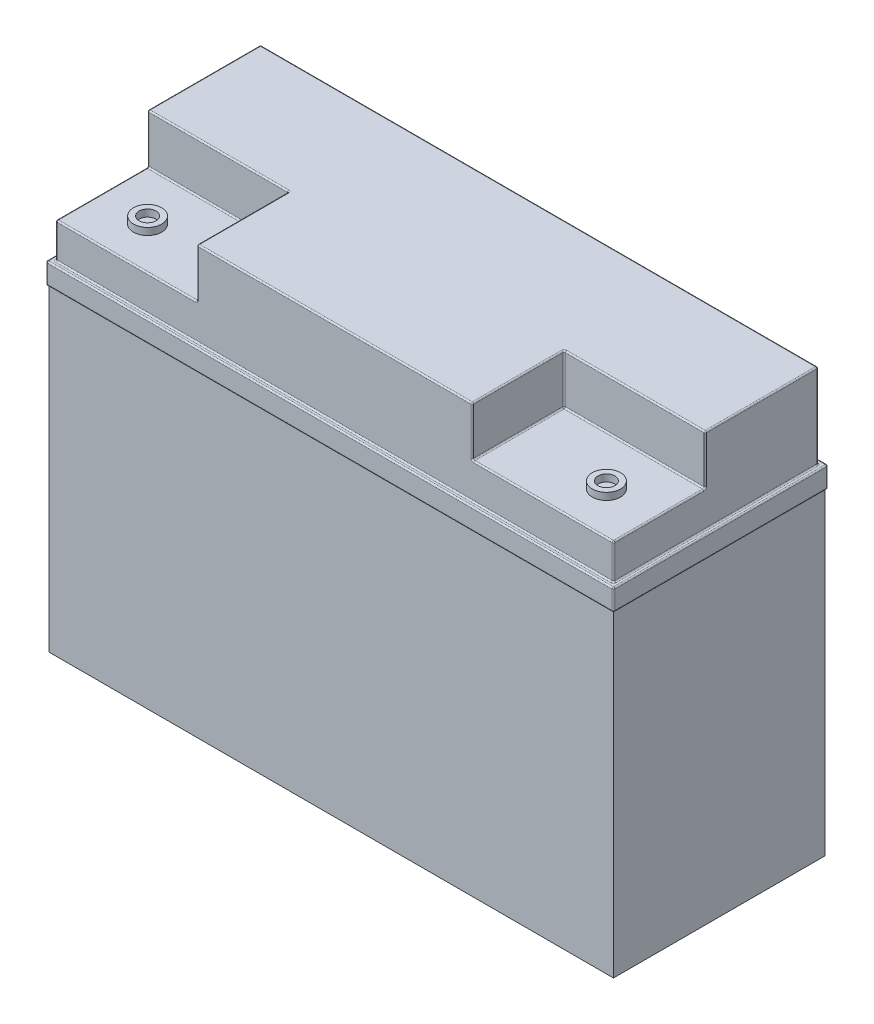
ISO-10303-21;
HEADER;
FILE_DESCRIPTION(('STEP AP214'),'2;1');
FILE_NAME('part.step','',(''),(''),'','','');
FILE_SCHEMA(('AUTOMOTIVE_DESIGN { 1 0 10303 214 1 1 1 1 }'));
ENDSEC;
DATA;
#1=APPLICATION_CONTEXT('core data for automotive mechanical design processes');
#2=APPLICATION_PROTOCOL_DEFINITION('international standard','automotive_design',2000,#1);
#3=PRODUCT_CONTEXT('',#1,'mechanical');
#4=PRODUCT('Part','Part','',(#3));
#5=PRODUCT_RELATED_PRODUCT_CATEGORY('part','',(#4));
#6=PRODUCT_DEFINITION_FORMATION('','',#4);
#7=PRODUCT_DEFINITION_CONTEXT('part definition',#1,'design');
#8=PRODUCT_DEFINITION('design','',#6,#7);
#9=PRODUCT_DEFINITION_SHAPE('','',#8);
#10=(LENGTH_UNIT() NAMED_UNIT(*) SI_UNIT(.MILLI.,.METRE.));
#11=(NAMED_UNIT(*) PLANE_ANGLE_UNIT() SI_UNIT($,.RADIAN.));
#12=(NAMED_UNIT(*) SI_UNIT($,.STERADIAN.) SOLID_ANGLE_UNIT());
#13=UNCERTAINTY_MEASURE_WITH_UNIT(LENGTH_MEASURE(1.E-05),#10,'distance_accuracy_value','');
#14=(GEOMETRIC_REPRESENTATION_CONTEXT(3) GLOBAL_UNCERTAINTY_ASSIGNED_CONTEXT((#13)) GLOBAL_UNIT_ASSIGNED_CONTEXT((#10,
#11,#12)) REPRESENTATION_CONTEXT('',''));
#15=CARTESIAN_POINT('',(0.,0.,0.));
#16=DIRECTION('',(0.,0.,1.));
#17=DIRECTION('',(1.,0.,0.));
#18=AXIS2_PLACEMENT_3D('',#15,#16,#17);
#19=CARTESIAN_POINT('',(102.108,121.92,-38.608));
#20=DIRECTION('',(0.,1.,0.));
#21=DIRECTION('',(0.,0.,1.));
#22=AXIS2_PLACEMENT_3D('',#19,#20,#21);
#23=PLANE('',#22);
#24=DIRECTION('',(1.,0.,0.));
#25=VECTOR('',#24,1.);
#26=CARTESIAN_POINT('',(102.108,121.92,38.1));
#27=LINE('',#26,#25);
#28=CARTESIAN_POINT('',(-101.6,121.92,38.1));
#29=VERTEX_POINT('',#28);
#30=CARTESIAN_POINT('',(101.6,121.92,38.1));
#31=VERTEX_POINT('',#30);
#32=EDGE_CURVE('E462',#29,#31,#27,.T.);
#33=ORIENTED_EDGE('',*,*,#32,.T.);
#34=DIRECTION('',(0.,0.,-1.));
#35=VECTOR('',#34,1.);
#36=CARTESIAN_POINT('',(101.6,121.92,-38.608));
#37=LINE('',#36,#35);
#38=CARTESIAN_POINT('',(101.6,121.92,-38.1));
#39=VERTEX_POINT('',#38);
#40=EDGE_CURVE('E464',#31,#39,#37,.T.);
#41=ORIENTED_EDGE('',*,*,#40,.T.);
#42=DIRECTION('',(-1.,0.,0.));
#43=VECTOR('',#42,1.);
#44=CARTESIAN_POINT('',(-102.108,121.92,-38.1));
#45=LINE('',#44,#43);
#46=CARTESIAN_POINT('',(-101.6,121.92,-38.1));
#47=VERTEX_POINT('',#46);
#48=EDGE_CURVE('E460',#39,#47,#45,.T.);
#49=ORIENTED_EDGE('',*,*,#48,.T.);
#50=DIRECTION('',(0.,0.,1.));
#51=VECTOR('',#50,1.);
#52=CARTESIAN_POINT('',(-101.6,121.92,38.608));
#53=LINE('',#52,#51);
#54=EDGE_CURVE('E458',#47,#29,#53,.T.);
#55=ORIENTED_EDGE('',*,*,#54,.T.);
#56=EDGE_LOOP('',(#33,#41,#49,#55));
#57=FACE_BOUND('',#56,.T.);
#58=CARTESIAN_POINT('',(-99.822,121.92,-36.322));
#59=DIRECTION('',(0.,1.,0.));
#60=DIRECTION('',(0.,0.,1.));
#61=AXIS2_PLACEMENT_3D('',#58,#59,#60);
#62=CIRCLE('',#61,1.016);
#63=CARTESIAN_POINT('',(-99.822,121.92,-37.338));
#64=VERTEX_POINT('',#63);
#65=CARTESIAN_POINT('',(-100.838,121.92,-36.322));
#66=VERTEX_POINT('',#65);
#67=EDGE_CURVE('E455',#64,#66,#62,.T.);
#68=ORIENTED_EDGE('',*,*,#67,.F.);
#69=DIRECTION('',(-1.,0.,0.));
#70=VECTOR('',#69,1.);
#71=CARTESIAN_POINT('',(102.108,121.92,-37.338));
#72=LINE('',#71,#70);
#73=CARTESIAN_POINT('',(99.822,121.92,-37.338));
#74=VERTEX_POINT('',#73);
#75=EDGE_CURVE('E452',#64,#74,#72,.F.);
#76=ORIENTED_EDGE('',*,*,#75,.T.);
#77=CARTESIAN_POINT('',(99.822,121.92,-36.322));
#78=DIRECTION('',(0.,1.,0.));
#79=DIRECTION('',(0.,0.,1.));
#80=AXIS2_PLACEMENT_3D('',#77,#78,#79);
#81=CIRCLE('',#80,1.016);
#82=CARTESIAN_POINT('',(100.838,121.92,-36.322));
#83=VERTEX_POINT('',#82);
#84=EDGE_CURVE('E449',#83,#74,#81,.T.);
#85=ORIENTED_EDGE('',*,*,#84,.F.);
#86=DIRECTION('',(0.,0.,-1.));
#87=VECTOR('',#86,1.);
#88=CARTESIAN_POINT('',(100.838,121.92,-38.608));
#89=LINE('',#88,#87);
#90=CARTESIAN_POINT('',(100.838,121.92,36.322));
#91=VERTEX_POINT('',#90);
#92=EDGE_CURVE('E445',#83,#91,#89,.F.);
#93=ORIENTED_EDGE('',*,*,#92,.T.);
#94=CARTESIAN_POINT('',(99.822,121.92,36.322));
#95=DIRECTION('',(0.,1.,0.));
#96=DIRECTION('',(0.,0.,1.));
#97=AXIS2_PLACEMENT_3D('',#94,#95,#96);
#98=CIRCLE('',#97,1.016);
#99=CARTESIAN_POINT('',(99.822,121.92,37.338));
#100=VERTEX_POINT('',#99);
#101=EDGE_CURVE('E442',#100,#91,#98,.T.);
#102=ORIENTED_EDGE('',*,*,#101,.F.);
#103=DIRECTION('',(1.,0.,0.));
#104=VECTOR('',#103,1.);
#105=CARTESIAN_POINT('',(102.108,121.92,37.338));
#106=LINE('',#105,#104);
#107=CARTESIAN_POINT('',(-99.822,121.92,37.338));
#108=VERTEX_POINT('',#107);
#109=EDGE_CURVE('E440',#100,#108,#106,.F.);
#110=ORIENTED_EDGE('',*,*,#109,.T.);
#111=CARTESIAN_POINT('',(-99.822,121.92,36.322));
#112=DIRECTION('',(0.,1.,0.));
#113=DIRECTION('',(0.,0.,1.));
#114=AXIS2_PLACEMENT_3D('',#111,#112,#113);
#115=CIRCLE('',#114,1.016);
#116=CARTESIAN_POINT('',(-100.838,121.92,36.322));
#117=VERTEX_POINT('',#116);
#118=EDGE_CURVE('E437',#117,#108,#115,.T.);
#119=ORIENTED_EDGE('',*,*,#118,.F.);
#120=DIRECTION('',(0.,0.,1.));
#121=VECTOR('',#120,1.);
#122=CARTESIAN_POINT('',(-100.838,121.92,-38.608));
#123=LINE('',#122,#121);
#124=EDGE_CURVE('E447',#117,#66,#123,.F.);
#125=ORIENTED_EDGE('',*,*,#124,.T.);
#126=EDGE_LOOP('',(#68,#76,#85,#93,#102,#110,#119,#125));
#127=FACE_BOUND('',#126,.T.);
#128=ADVANCED_FACE('F51',(#57,#127),#23,.T.);
#129=CARTESIAN_POINT('',(100.33,152.4,-36.83));
#130=DIRECTION('',(0.,1.,0.));
#131=DIRECTION('',(0.,0.,1.));
#132=AXIS2_PLACEMENT_3D('',#129,#130,#131);
#133=PLANE('',#132);
#134=CARTESIAN_POINT('',(-50.038,152.4,4.318));
#135=DIRECTION('',(0.,1.,0.));
#136=DIRECTION('',(0.,0.,1.));
#137=AXIS2_PLACEMENT_3D('',#134,#135,#136);
#138=CIRCLE('',#137,1.016);
#139=CARTESIAN_POINT('',(-49.022,152.4,4.318));
#140=VERTEX_POINT('',#139);
#141=CARTESIAN_POINT('',(-50.038,152.4,3.302));
#142=VERTEX_POINT('',#141);
#143=EDGE_CURVE('E60',#140,#142,#138,.T.);
#144=ORIENTED_EDGE('',*,*,#143,.F.);
#145=DIRECTION('',(0.,0.,-1.));
#146=VECTOR('',#145,1.);
#147=CARTESIAN_POINT('',(-49.022,152.4,36.83));
#148=LINE('',#147,#146);
#149=CARTESIAN_POINT('',(-49.022,152.4,36.322));
#150=VERTEX_POINT('',#149);
#151=EDGE_CURVE('E12',#140,#150,#148,.F.);
#152=ORIENTED_EDGE('',*,*,#151,.T.);
#153=DIRECTION('',(1.,0.,0.));
#154=VECTOR('',#153,1.);
#155=CARTESIAN_POINT('',(49.53,152.4,36.322));
#156=LINE('',#155,#154);
#157=CARTESIAN_POINT('',(49.022,152.4,36.322));
#158=VERTEX_POINT('',#157);
#159=EDGE_CURVE('E625',#150,#158,#156,.T.);
#160=ORIENTED_EDGE('',*,*,#159,.T.);
#161=DIRECTION('',(0.,0.,-1.));
#162=VECTOR('',#161,1.);
#163=CARTESIAN_POINT('',(49.022,152.4,3.81));
#164=LINE('',#163,#162);
#165=CARTESIAN_POINT('',(49.022,152.4,4.318));
#166=VERTEX_POINT('',#165);
#167=EDGE_CURVE('E613',#158,#166,#164,.T.);
#168=ORIENTED_EDGE('',*,*,#167,.T.);
#169=CARTESIAN_POINT('',(50.038,152.4,4.318));
#170=DIRECTION('',(0.,1.,0.));
#171=DIRECTION('',(0.,0.,1.));
#172=AXIS2_PLACEMENT_3D('',#169,#170,#171);
#173=CIRCLE('',#172,1.016);
#174=CARTESIAN_POINT('',(50.038,152.4,3.302));
#175=VERTEX_POINT('',#174);
#176=EDGE_CURVE('E610',#175,#166,#173,.T.);
#177=ORIENTED_EDGE('',*,*,#176,.F.);
#178=DIRECTION('',(1.,0.,0.));
#179=VECTOR('',#178,1.);
#180=CARTESIAN_POINT('',(100.33,152.4,3.302));
#181=LINE('',#180,#179);
#182=CARTESIAN_POINT('',(99.822,152.4,3.302));
#183=VERTEX_POINT('',#182);
#184=EDGE_CURVE('E615',#175,#183,#181,.T.);
#185=ORIENTED_EDGE('',*,*,#184,.T.);
#186=DIRECTION('',(0.,0.,-1.));
#187=VECTOR('',#186,1.);
#188=CARTESIAN_POINT('',(99.822,152.4,-36.83));
#189=LINE('',#188,#187);
#190=CARTESIAN_POINT('',(99.822,152.4,-36.322));
#191=VERTEX_POINT('',#190);
#192=EDGE_CURVE('E617',#183,#191,#189,.T.);
#193=ORIENTED_EDGE('',*,*,#192,.T.);
#194=DIRECTION('',(-1.,0.,0.));
#195=VECTOR('',#194,1.);
#196=CARTESIAN_POINT('',(-100.33,152.4,-36.322));
#197=LINE('',#196,#195);
#198=CARTESIAN_POINT('',(-99.822,152.4,-36.322));
#199=VERTEX_POINT('',#198);
#200=EDGE_CURVE('E619',#191,#199,#197,.T.);
#201=ORIENTED_EDGE('',*,*,#200,.T.);
#202=DIRECTION('',(0.,0.,1.));
#203=VECTOR('',#202,1.);
#204=CARTESIAN_POINT('',(-99.822,152.4,3.81));
#205=LINE('',#204,#203);
#206=CARTESIAN_POINT('',(-99.822,152.4,3.302));
#207=VERTEX_POINT('',#206);
#208=EDGE_CURVE('E621',#199,#207,#205,.T.);
#209=ORIENTED_EDGE('',*,*,#208,.T.);
#210=DIRECTION('',(-1.,0.,0.));
#211=VECTOR('',#210,1.);
#212=CARTESIAN_POINT('',(-49.53,152.4,3.302));
#213=LINE('',#212,#211);
#214=EDGE_CURVE('E623',#207,#142,#213,.F.);
#215=ORIENTED_EDGE('',*,*,#214,.T.);
#216=EDGE_LOOP('',(#144,#152,#160,#168,#177,#185,#193,#201,#209,#215));
#217=FACE_BOUND('',#216,.T.);
#218=ADVANCED_FACE('F928',(#217),#133,.T.);
#219=CARTESIAN_POINT('',(-100.33,152.4,36.83));
#220=DIRECTION('',(0.,0.,-1.));
#221=DIRECTION('',(-1.,0.,0.));
#222=AXIS2_PLACEMENT_3D('',#219,#220,#221);
#223=PLANE('',#222);
#224=DIRECTION('',(1.,0.,0.));
#225=VECTOR('',#224,1.);
#226=CARTESIAN_POINT('',(-100.33,122.428,36.83));
#227=LINE('',#226,#225);
#228=CARTESIAN_POINT('',(-99.822,122.428,36.83));
#229=VERTEX_POINT('',#228);
#230=CARTESIAN_POINT('',(99.822,122.428,36.83));
#231=VERTEX_POINT('',#230);
#232=EDGE_CURVE('E605',#229,#231,#227,.T.);
#233=ORIENTED_EDGE('',*,*,#232,.T.);
#234=DIRECTION('',(0.,-1.,0.));
#235=VECTOR('',#234,1.);
#236=CARTESIAN_POINT('',(99.822,152.4,36.83));
#237=LINE('',#236,#235);
#238=CARTESIAN_POINT('',(99.822,134.112,36.83));
#239=VERTEX_POINT('',#238);
#240=EDGE_CURVE('E607',#231,#239,#237,.F.);
#241=ORIENTED_EDGE('',*,*,#240,.T.);
#242=DIRECTION('',(1.,0.,0.));
#243=VECTOR('',#242,1.);
#244=CARTESIAN_POINT('',(49.53,134.112,36.83));
#245=LINE('',#244,#243);
#246=CARTESIAN_POINT('',(50.038,134.112,36.83));
#247=VERTEX_POINT('',#246);
#248=EDGE_CURVE('E596',#239,#247,#245,.F.);
#249=ORIENTED_EDGE('',*,*,#248,.T.);
#250=CARTESIAN_POINT('',(50.038,135.128,36.83));
#251=DIRECTION('',(0.,0.,-1.));
#252=DIRECTION('',(-1.,0.,0.));
#253=AXIS2_PLACEMENT_3D('',#250,#251,#252);
#254=CIRCLE('',#253,1.016);
#255=CARTESIAN_POINT('',(49.022,135.128,36.83));
#256=VERTEX_POINT('',#255);
#257=EDGE_CURVE('E593',#256,#247,#254,.F.);
#258=ORIENTED_EDGE('',*,*,#257,.F.);
#259=DIRECTION('',(0.,1.,0.));
#260=VECTOR('',#259,1.);
#261=CARTESIAN_POINT('',(49.022,152.4,36.83));
#262=LINE('',#261,#260);
#263=CARTESIAN_POINT('',(49.022,151.892,36.83));
#264=VERTEX_POINT('',#263);
#265=EDGE_CURVE('E589',#256,#264,#262,.T.);
#266=ORIENTED_EDGE('',*,*,#265,.T.);
#267=DIRECTION('',(1.,0.,0.));
#268=VECTOR('',#267,1.);
#269=CARTESIAN_POINT('',(-49.53,151.892,36.83));
#270=LINE('',#269,#268);
#271=CARTESIAN_POINT('',(-49.022,151.892,36.83));
#272=VERTEX_POINT('',#271);
#273=EDGE_CURVE('E587',#264,#272,#270,.F.);
#274=ORIENTED_EDGE('',*,*,#273,.T.);
#275=DIRECTION('',(0.,1.,0.));
#276=VECTOR('',#275,1.);
#277=CARTESIAN_POINT('',(-49.022,152.4,36.83));
#278=LINE('',#277,#276);
#279=CARTESIAN_POINT('',(-49.022,135.128,36.83));
#280=VERTEX_POINT('',#279);
#281=EDGE_CURVE('E591',#272,#280,#278,.F.);
#282=ORIENTED_EDGE('',*,*,#281,.T.);
#283=CARTESIAN_POINT('',(-50.038,135.128,36.83));
#284=DIRECTION('',(0.,0.,-1.));
#285=DIRECTION('',(-1.,0.,0.));
#286=AXIS2_PLACEMENT_3D('',#283,#284,#285);
#287=CIRCLE('',#286,1.016);
#288=CARTESIAN_POINT('',(-50.038,134.112,36.83));
#289=VERTEX_POINT('',#288);
#290=EDGE_CURVE('E598',#289,#280,#287,.F.);
#291=ORIENTED_EDGE('',*,*,#290,.F.);
#292=DIRECTION('',(-1.,0.,0.));
#293=VECTOR('',#292,1.);
#294=CARTESIAN_POINT('',(-100.33,134.112,36.83));
#295=LINE('',#294,#293);
#296=CARTESIAN_POINT('',(-99.822,134.112,36.83));
#297=VERTEX_POINT('',#296);
#298=EDGE_CURVE('E601',#289,#297,#295,.T.);
#299=ORIENTED_EDGE('',*,*,#298,.T.);
#300=DIRECTION('',(0.,-1.,0.));
#301=VECTOR('',#300,1.);
#302=CARTESIAN_POINT('',(-99.822,152.4,36.83));
#303=LINE('',#302,#301);
#304=EDGE_CURVE('E603',#297,#229,#303,.T.);
#305=ORIENTED_EDGE('',*,*,#304,.T.);
#306=EDGE_LOOP('',(#233,#241,#249,#258,#266,#274,#282,#291,#299,#305));
#307=FACE_BOUND('',#306,.T.);
#308=ADVANCED_FACE('F934',(#307),#223,.F.);
#309=CARTESIAN_POINT('',(100.33,152.4,36.83));
#310=DIRECTION('',(-1.,0.,0.));
#311=DIRECTION('',(0.,0.,1.));
#312=AXIS2_PLACEMENT_3D('',#309,#310,#311);
#313=PLANE('',#312);
#314=DIRECTION('',(0.,0.,1.));
#315=VECTOR('',#314,1.);
#316=CARTESIAN_POINT('',(100.33,134.112,36.83));
#317=LINE('',#316,#315);
#318=CARTESIAN_POINT('',(100.33,134.112,4.318));
#319=VERTEX_POINT('',#318);
#320=CARTESIAN_POINT('',(100.33,134.112,36.322));
#321=VERTEX_POINT('',#320);
#322=EDGE_CURVE('E581',#319,#321,#317,.T.);
#323=ORIENTED_EDGE('',*,*,#322,.T.);
#324=DIRECTION('',(0.,-1.,0.));
#325=VECTOR('',#324,1.);
#326=CARTESIAN_POINT('',(100.33,152.4,36.322));
#327=LINE('',#326,#325);
#328=CARTESIAN_POINT('',(100.33,122.428,36.322));
#329=VERTEX_POINT('',#328);
#330=EDGE_CURVE('E585',#321,#329,#327,.T.);
#331=ORIENTED_EDGE('',*,*,#330,.T.);
#332=DIRECTION('',(0.,0.,-1.));
#333=VECTOR('',#332,1.);
#334=CARTESIAN_POINT('',(100.33,122.428,36.83));
#335=LINE('',#334,#333);
#336=CARTESIAN_POINT('',(100.33,122.428,-36.322));
#337=VERTEX_POINT('',#336);
#338=EDGE_CURVE('E583',#329,#337,#335,.T.);
#339=ORIENTED_EDGE('',*,*,#338,.T.);
#340=DIRECTION('',(0.,-1.,0.));
#341=VECTOR('',#340,1.);
#342=CARTESIAN_POINT('',(100.33,152.4,-36.322));
#343=LINE('',#342,#341);
#344=CARTESIAN_POINT('',(100.33,151.892,-36.322));
#345=VERTEX_POINT('',#344);
#346=EDGE_CURVE('E575',#337,#345,#343,.F.);
#347=ORIENTED_EDGE('',*,*,#346,.T.);
#348=DIRECTION('',(0.,0.,-1.));
#349=VECTOR('',#348,1.);
#350=CARTESIAN_POINT('',(100.33,151.892,3.81));
#351=LINE('',#350,#349);
#352=CARTESIAN_POINT('',(100.33,151.892,3.302));
#353=VERTEX_POINT('',#352);
#354=EDGE_CURVE('E571',#345,#353,#351,.F.);
#355=ORIENTED_EDGE('',*,*,#354,.T.);
#356=DIRECTION('',(0.,-1.,0.));
#357=VECTOR('',#356,1.);
#358=CARTESIAN_POINT('',(100.33,134.62,3.302));
#359=LINE('',#358,#357);
#360=CARTESIAN_POINT('',(100.33,135.128,3.302));
#361=VERTEX_POINT('',#360);
#362=EDGE_CURVE('E573',#353,#361,#359,.T.);
#363=ORIENTED_EDGE('',*,*,#362,.T.);
#364=CARTESIAN_POINT('',(100.33,135.128,4.318));
#365=DIRECTION('',(-1.,0.,0.));
#366=DIRECTION('',(0.,0.,1.));
#367=AXIS2_PLACEMENT_3D('',#364,#365,#366);
#368=CIRCLE('',#367,1.016);
#369=EDGE_CURVE('E578',#319,#361,#368,.F.);
#370=ORIENTED_EDGE('',*,*,#369,.F.);
#371=EDGE_LOOP('',(#323,#331,#339,#347,#355,#363,#370));
#372=FACE_BOUND('',#371,.T.);
#373=ADVANCED_FACE('F954',(#372),#313,.F.);
#374=CARTESIAN_POINT('',(-49.53,134.62,36.83));
#375=DIRECTION('',(0.,-1.,0.));
#376=DIRECTION('',(0.,0.,-1.));
#377=AXIS2_PLACEMENT_3D('',#374,#375,#376);
#378=PLANE('',#377);
#379=DIRECTION('',(-1.,0.,0.));
#380=VECTOR('',#379,1.);
#381=CARTESIAN_POINT('',(-100.33,134.62,4.318));
#382=LINE('',#381,#380);
#383=CARTESIAN_POINT('',(-50.038,134.62,4.318));
#384=VERTEX_POINT('',#383);
#385=CARTESIAN_POINT('',(-99.822,134.62,4.318));
#386=VERTEX_POINT('',#385);
#387=EDGE_CURVE('E521',#384,#386,#382,.T.);
#388=ORIENTED_EDGE('',*,*,#387,.T.);
#389=DIRECTION('',(0.,0.,1.));
#390=VECTOR('',#389,1.);
#391=CARTESIAN_POINT('',(-99.822,134.62,36.83));
#392=LINE('',#391,#390);
#393=CARTESIAN_POINT('',(-99.822,134.62,36.322));
#394=VERTEX_POINT('',#393);
#395=EDGE_CURVE('E523',#386,#394,#392,.T.);
#396=ORIENTED_EDGE('',*,*,#395,.T.);
#397=DIRECTION('',(-1.,0.,0.));
#398=VECTOR('',#397,1.);
#399=CARTESIAN_POINT('',(-49.53,134.62,36.322));
#400=LINE('',#399,#398);
#401=CARTESIAN_POINT('',(-50.038,134.62,36.322));
#402=VERTEX_POINT('',#401);
#403=EDGE_CURVE('E517',#394,#402,#400,.F.);
#404=ORIENTED_EDGE('',*,*,#403,.T.);
#405=DIRECTION('',(0.,0.,1.));
#406=VECTOR('',#405,1.);
#407=CARTESIAN_POINT('',(-50.038,134.62,3.81));
#408=LINE('',#407,#406);
#409=EDGE_CURVE('E519',#402,#384,#408,.F.);
#410=ORIENTED_EDGE('',*,*,#409,.T.);
#411=EDGE_LOOP('',(#388,#396,#404,#410));
#412=FACE_BOUND('',#411,.T.);
#413=CARTESIAN_POINT('',(-82.55,134.62,21.59));
#414=DIRECTION('',(0.,-1.,0.));
#415=DIRECTION('',(0.,0.,-1.));
#416=AXIS2_PLACEMENT_3D('',#413,#414,#415);
#417=CIRCLE('',#416,5.08);
#418=CARTESIAN_POINT('',(-82.55,134.62,16.51));
#419=VERTEX_POINT('',#418);
#420=EDGE_CURVE('E422',#419,#419,#417,.F.);
#421=ORIENTED_EDGE('',*,*,#420,.F.);
#422=EDGE_LOOP('',(#421));
#423=FACE_BOUND('',#422,.T.);
#424=ADVANCED_FACE('F965',(#412,#423),#378,.F.);
#425=CARTESIAN_POINT('',(-101.6,0.,38.1));
#426=DIRECTION('',(1.,0.,0.));
#427=DIRECTION('',(0.,0.,-1.));
#428=AXIS2_PLACEMENT_3D('',#425,#426,#427);
#429=PLANE('',#428);
#430=DIRECTION('',(0.,-1.,0.));
#431=VECTOR('',#430,1.);
#432=CARTESIAN_POINT('',(-101.6,0.,-38.1));
#433=LINE('',#432,#431);
#434=CARTESIAN_POINT('',(-101.6,114.3,-38.1));
#435=VERTEX_POINT('',#434);
#436=CARTESIAN_POINT('',(-101.6,0.,-38.1));
#437=VERTEX_POINT('',#436);
#438=EDGE_CURVE('E360',#435,#437,#433,.T.);
#439=ORIENTED_EDGE('',*,*,#438,.T.);
#440=DIRECTION('',(0.,0.,-1.));
#441=VECTOR('',#440,1.);
#442=CARTESIAN_POINT('',(-101.6,0.,38.1));
#443=LINE('',#442,#441);
#444=CARTESIAN_POINT('',(-101.6,0.,38.1));
#445=VERTEX_POINT('',#444);
#446=EDGE_CURVE('E420',#445,#437,#443,.T.);
#447=ORIENTED_EDGE('',*,*,#446,.F.);
#448=DIRECTION('',(0.,-1.,0.));
#449=VECTOR('',#448,1.);
#450=CARTESIAN_POINT('',(-101.6,0.,38.1));
#451=LINE('',#450,#449);
#452=CARTESIAN_POINT('',(-101.6,114.3,38.1));
#453=VERTEX_POINT('',#452);
#454=EDGE_CURVE('E379',#453,#445,#451,.T.);
#455=ORIENTED_EDGE('',*,*,#454,.F.);
#456=DIRECTION('',(0.,0.,-1.));
#457=VECTOR('',#456,1.);
#458=CARTESIAN_POINT('',(-101.6,114.3,38.1));
#459=LINE('',#458,#457);
#460=EDGE_CURVE('E375',#453,#435,#459,.T.);
#461=ORIENTED_EDGE('',*,*,#460,.T.);
#462=EDGE_LOOP('',(#439,#447,#455,#461));
#463=FACE_BOUND('',#462,.T.);
#464=ADVANCED_FACE('F377',(#463),#429,.F.);
#465=CARTESIAN_POINT('',(-101.6,0.,38.1));
#466=DIRECTION('',(0.,1.,0.));
#467=DIRECTION('',(0.,0.,1.));
#468=AXIS2_PLACEMENT_3D('',#465,#466,#467);
#469=PLANE('',#468);
#470=DIRECTION('',(1.,0.,0.));
#471=VECTOR('',#470,1.);
#472=CARTESIAN_POINT('',(-101.6,0.,-38.1));
#473=LINE('',#472,#471);
#474=CARTESIAN_POINT('',(101.6,0.,-38.1));
#475=VERTEX_POINT('',#474);
#476=EDGE_CURVE('E367',#437,#475,#473,.T.);
#477=ORIENTED_EDGE('',*,*,#476,.T.);
#478=DIRECTION('',(0.,0.,-1.));
#479=VECTOR('',#478,1.);
#480=CARTESIAN_POINT('',(101.6,0.,38.1));
#481=LINE('',#480,#479);
#482=CARTESIAN_POINT('',(101.6,0.,38.1));
#483=VERTEX_POINT('',#482);
#484=EDGE_CURVE('E417',#483,#475,#481,.T.);
#485=ORIENTED_EDGE('',*,*,#484,.F.);
#486=DIRECTION('',(1.,0.,0.));
#487=VECTOR('',#486,1.);
#488=CARTESIAN_POINT('',(-101.6,0.,38.1));
#489=LINE('',#488,#487);
#490=EDGE_CURVE('E411',#445,#483,#489,.T.);
#491=ORIENTED_EDGE('',*,*,#490,.F.);
#492=ORIENTED_EDGE('',*,*,#446,.T.);
#493=EDGE_LOOP('',(#477,#485,#491,#492));
#494=FACE_BOUND('',#493,.T.);
#495=ADVANCED_FACE('F976',(#494),#469,.F.);
#496=CARTESIAN_POINT('',(101.6,0.,38.1));
#497=DIRECTION('',(-1.,0.,0.));
#498=DIRECTION('',(0.,0.,1.));
#499=AXIS2_PLACEMENT_3D('',#496,#497,#498);
#500=PLANE('',#499);
#501=DIRECTION('',(0.,1.,0.));
#502=VECTOR('',#501,1.);
#503=CARTESIAN_POINT('',(101.6,0.,-38.1));
#504=LINE('',#503,#502);
#505=CARTESIAN_POINT('',(101.6,114.3,-38.1));
#506=VERTEX_POINT('',#505);
#507=EDGE_CURVE('E409',#475,#506,#504,.T.);
#508=ORIENTED_EDGE('',*,*,#507,.T.);
#509=DIRECTION('',(0.,0.,-1.));
#510=VECTOR('',#509,1.);
#511=CARTESIAN_POINT('',(101.6,114.3,38.1));
#512=LINE('',#511,#510);
#513=CARTESIAN_POINT('',(101.6,114.3,38.1));
#514=VERTEX_POINT('',#513);
#515=EDGE_CURVE('E383',#514,#506,#512,.T.);
#516=ORIENTED_EDGE('',*,*,#515,.F.);
#517=DIRECTION('',(0.,1.,0.));
#518=VECTOR('',#517,1.);
#519=CARTESIAN_POINT('',(101.6,0.,38.1));
#520=LINE('',#519,#518);
#521=EDGE_CURVE('E2023',#483,#514,#520,.T.);
#522=ORIENTED_EDGE('',*,*,#521,.F.);
#523=ORIENTED_EDGE('',*,*,#484,.T.);
#524=EDGE_LOOP('',(#508,#516,#522,#523));
#525=FACE_BOUND('',#524,.T.);
#526=ADVANCED_FACE('F970',(#525),#500,.F.);
#527=CARTESIAN_POINT('',(-101.6,114.3,38.1));
#528=DIRECTION('',(0.,0.,-1.));
#529=DIRECTION('',(-1.,0.,0.));
#530=AXIS2_PLACEMENT_3D('',#527,#528,#529);
#531=PLANE('',#530);
#532=ORIENTED_EDGE('',*,*,#454,.T.);
#533=ORIENTED_EDGE('',*,*,#490,.T.);
#534=ORIENTED_EDGE('',*,*,#521,.T.);
#535=DIRECTION('',(-1.,0.,0.));
#536=VECTOR('',#535,1.);
#537=CARTESIAN_POINT('',(-101.6,114.3,38.1));
#538=LINE('',#537,#536);
#539=EDGE_CURVE('E384',#514,#453,#538,.T.);
#540=ORIENTED_EDGE('',*,*,#539,.T.);
#541=EDGE_LOOP('',(#532,#533,#534,#540));
#542=FACE_BOUND('',#541,.T.);
#543=ADVANCED_FACE('F967',(#542),#531,.F.);
#544=CARTESIAN_POINT('',(-101.6,114.3,-38.1));
#545=DIRECTION('',(0.,0.,-1.));
#546=DIRECTION('',(-1.,0.,0.));
#547=AXIS2_PLACEMENT_3D('',#544,#545,#546);
#548=PLANE('',#547);
#549=ORIENTED_EDGE('',*,*,#438,.F.);
#550=DIRECTION('',(-1.,0.,0.));
#551=VECTOR('',#550,1.);
#552=CARTESIAN_POINT('',(-101.6,114.3,-38.1));
#553=LINE('',#552,#551);
#554=EDGE_CURVE('E365',#506,#435,#553,.T.);
#555=ORIENTED_EDGE('',*,*,#554,.F.);
#556=ORIENTED_EDGE('',*,*,#507,.F.);
#557=ORIENTED_EDGE('',*,*,#476,.F.);
#558=EDGE_LOOP('',(#549,#555,#556,#557));
#559=FACE_BOUND('',#558,.T.);
#560=ADVANCED_FACE('F362',(#559),#548,.T.);
#561=CARTESIAN_POINT('',(102.108,121.92,38.608));
#562=DIRECTION('',(-1.,0.,0.));
#563=DIRECTION('',(0.,0.,1.));
#564=AXIS2_PLACEMENT_3D('',#561,#562,#563);
#565=PLANE('',#564);
#566=DIRECTION('',(0.,0.,-1.));
#567=VECTOR('',#566,1.);
#568=CARTESIAN_POINT('',(102.108,121.412,38.608));
#569=LINE('',#568,#567);
#570=CARTESIAN_POINT('',(102.108,121.412,-38.1));
#571=VERTEX_POINT('',#570);
#572=CARTESIAN_POINT('',(102.108,121.412,38.1));
#573=VERTEX_POINT('',#572);
#574=EDGE_CURVE('E471',#571,#573,#569,.F.);
#575=ORIENTED_EDGE('',*,*,#574,.T.);
#576=DIRECTION('',(0.,-1.,0.));
#577=VECTOR('',#576,1.);
#578=CARTESIAN_POINT('',(102.108,121.92,38.1));
#579=LINE('',#578,#577);
#580=CARTESIAN_POINT('',(102.108,114.808,38.1));
#581=VERTEX_POINT('',#580);
#582=EDGE_CURVE('E474',#573,#581,#579,.T.);
#583=ORIENTED_EDGE('',*,*,#582,.T.);
#584=DIRECTION('',(0.,0.,-1.));
#585=VECTOR('',#584,1.);
#586=CARTESIAN_POINT('',(102.108,114.808,38.608));
#587=LINE('',#586,#585);
#588=CARTESIAN_POINT('',(102.108,114.808,-38.1));
#589=VERTEX_POINT('',#588);
#590=EDGE_CURVE('E469',#581,#589,#587,.T.);
#591=ORIENTED_EDGE('',*,*,#590,.T.);
#592=DIRECTION('',(0.,-1.,0.));
#593=VECTOR('',#592,1.);
#594=CARTESIAN_POINT('',(102.108,121.92,-38.1));
#595=LINE('',#594,#593);
#596=EDGE_CURVE('E467',#589,#571,#595,.F.);
#597=ORIENTED_EDGE('',*,*,#596,.T.);
#598=EDGE_LOOP('',(#575,#583,#591,#597));
#599=FACE_BOUND('',#598,.T.);
#600=ADVANCED_FACE('F905',(#599),#565,.F.);
#601=CARTESIAN_POINT('',(102.108,121.92,-38.608));
#602=DIRECTION('',(0.,0.,1.));
#603=DIRECTION('',(1.,0.,0.));
#604=AXIS2_PLACEMENT_3D('',#601,#602,#603);
#605=PLANE('',#604);
#606=DIRECTION('',(-1.,0.,0.));
#607=VECTOR('',#606,1.);
#608=CARTESIAN_POINT('',(102.108,121.412,-38.608));
#609=LINE('',#608,#607);
#610=CARTESIAN_POINT('',(-101.6,121.412,-38.608));
#611=VERTEX_POINT('',#610);
#612=CARTESIAN_POINT('',(101.6,121.412,-38.608));
#613=VERTEX_POINT('',#612);
#614=EDGE_CURVE('E489',#611,#613,#609,.F.);
#615=ORIENTED_EDGE('',*,*,#614,.T.);
#616=DIRECTION('',(0.,-1.,0.));
#617=VECTOR('',#616,1.);
#618=CARTESIAN_POINT('',(101.6,121.92,-38.608));
#619=LINE('',#618,#617);
#620=CARTESIAN_POINT('',(101.6,114.808,-38.608));
#621=VERTEX_POINT('',#620);
#622=EDGE_CURVE('E491',#613,#621,#619,.T.);
#623=ORIENTED_EDGE('',*,*,#622,.T.);
#624=DIRECTION('',(-1.,0.,0.));
#625=VECTOR('',#624,1.);
#626=CARTESIAN_POINT('',(102.108,114.808,-38.608));
#627=LINE('',#626,#625);
#628=CARTESIAN_POINT('',(-101.6,114.808,-38.608));
#629=VERTEX_POINT('',#628);
#630=EDGE_CURVE('E487',#621,#629,#627,.T.);
#631=ORIENTED_EDGE('',*,*,#630,.T.);
#632=DIRECTION('',(0.,-1.,0.));
#633=VECTOR('',#632,1.);
#634=CARTESIAN_POINT('',(-101.6,121.92,-38.608));
#635=LINE('',#634,#633);
#636=EDGE_CURVE('E485',#629,#611,#635,.F.);
#637=ORIENTED_EDGE('',*,*,#636,.T.);
#638=EDGE_LOOP('',(#615,#623,#631,#637));
#639=FACE_BOUND('',#638,.T.);
#640=ADVANCED_FACE('F885',(#639),#605,.F.);
#641=CARTESIAN_POINT('',(-102.108,121.92,-38.608));
#642=DIRECTION('',(1.,0.,0.));
#643=DIRECTION('',(0.,0.,-1.));
#644=AXIS2_PLACEMENT_3D('',#641,#642,#643);
#645=PLANE('',#644);
#646=DIRECTION('',(0.,0.,1.));
#647=VECTOR('',#646,1.);
#648=CARTESIAN_POINT('',(-102.108,121.412,-38.608));
#649=LINE('',#648,#647);
#650=CARTESIAN_POINT('',(-102.108,121.412,38.1));
#651=VERTEX_POINT('',#650);
#652=CARTESIAN_POINT('',(-102.108,121.412,-38.1));
#653=VERTEX_POINT('',#652);
#654=EDGE_CURVE('E497',#651,#653,#649,.F.);
#655=ORIENTED_EDGE('',*,*,#654,.T.);
#656=DIRECTION('',(0.,-1.,0.));
#657=VECTOR('',#656,1.);
#658=CARTESIAN_POINT('',(-102.108,121.92,-38.1));
#659=LINE('',#658,#657);
#660=CARTESIAN_POINT('',(-102.108,114.808,-38.1));
#661=VERTEX_POINT('',#660);
#662=EDGE_CURVE('E499',#653,#661,#659,.T.);
#663=ORIENTED_EDGE('',*,*,#662,.T.);
#664=DIRECTION('',(0.,0.,1.));
#665=VECTOR('',#664,1.);
#666=CARTESIAN_POINT('',(-102.108,114.808,-38.608));
#667=LINE('',#666,#665);
#668=CARTESIAN_POINT('',(-102.108,114.808,38.1));
#669=VERTEX_POINT('',#668);
#670=EDGE_CURVE('E390',#661,#669,#667,.T.);
#671=ORIENTED_EDGE('',*,*,#670,.T.);
#672=DIRECTION('',(0.,-1.,0.));
#673=VECTOR('',#672,1.);
#674=CARTESIAN_POINT('',(-102.108,121.92,38.1));
#675=LINE('',#674,#673);
#676=EDGE_CURVE('E495',#669,#651,#675,.F.);
#677=ORIENTED_EDGE('',*,*,#676,.T.);
#678=EDGE_LOOP('',(#655,#663,#671,#677));
#679=FACE_BOUND('',#678,.T.);
#680=ADVANCED_FACE('F869',(#679),#645,.F.);
#681=CARTESIAN_POINT('',(-102.108,121.92,38.608));
#682=DIRECTION('',(0.,0.,-1.));
#683=DIRECTION('',(-1.,0.,0.));
#684=AXIS2_PLACEMENT_3D('',#681,#682,#683);
#685=PLANE('',#684);
#686=DIRECTION('',(0.,-1.,0.));
#687=VECTOR('',#686,1.);
#688=CARTESIAN_POINT('',(101.6,121.92,38.608));
#689=LINE('',#688,#687);
#690=CARTESIAN_POINT('',(101.6,114.808,38.608));
#691=VERTEX_POINT('',#690);
#692=CARTESIAN_POINT('',(101.6,121.412,38.608));
#693=VERTEX_POINT('',#692);
#694=EDGE_CURVE('E480',#691,#693,#689,.F.);
#695=ORIENTED_EDGE('',*,*,#694,.T.);
#696=DIRECTION('',(1.,0.,0.));
#697=VECTOR('',#696,1.);
#698=CARTESIAN_POINT('',(-102.108,121.412,38.608));
#699=LINE('',#698,#697);
#700=CARTESIAN_POINT('',(-101.6,121.412,38.608));
#701=VERTEX_POINT('',#700);
#702=EDGE_CURVE('E482',#693,#701,#699,.F.);
#703=ORIENTED_EDGE('',*,*,#702,.T.);
#704=DIRECTION('',(0.,-1.,0.));
#705=VECTOR('',#704,1.);
#706=CARTESIAN_POINT('',(-101.6,121.92,38.608));
#707=LINE('',#706,#705);
#708=CARTESIAN_POINT('',(-101.6,114.808,38.608));
#709=VERTEX_POINT('',#708);
#710=EDGE_CURVE('E476',#701,#709,#707,.T.);
#711=ORIENTED_EDGE('',*,*,#710,.T.);
#712=DIRECTION('',(1.,0.,0.));
#713=VECTOR('',#712,1.);
#714=CARTESIAN_POINT('',(-102.108,114.808,38.608));
#715=LINE('',#714,#713);
#716=EDGE_CURVE('E478',#709,#691,#715,.T.);
#717=ORIENTED_EDGE('',*,*,#716,.T.);
#718=EDGE_LOOP('',(#695,#703,#711,#717));
#719=FACE_BOUND('',#718,.T.);
#720=ADVANCED_FACE('F941',(#719),#685,.F.);
#721=CARTESIAN_POINT('',(-100.33,152.4,-36.83));
#722=DIRECTION('',(1.,0.,0.));
#723=DIRECTION('',(0.,0.,-1.));
#724=AXIS2_PLACEMENT_3D('',#721,#722,#723);
#725=PLANE('',#724);
#726=DIRECTION('',(0.,0.,1.));
#727=VECTOR('',#726,1.);
#728=CARTESIAN_POINT('',(-100.33,122.428,-36.83));
#729=LINE('',#728,#727);
#730=CARTESIAN_POINT('',(-100.33,122.428,-36.322));
#731=VERTEX_POINT('',#730);
#732=CARTESIAN_POINT('',(-100.33,122.428,36.322));
#733=VERTEX_POINT('',#732);
#734=EDGE_CURVE('E512',#731,#733,#729,.T.);
#735=ORIENTED_EDGE('',*,*,#734,.T.);
#736=DIRECTION('',(0.,-1.,0.));
#737=VECTOR('',#736,1.);
#738=CARTESIAN_POINT('',(-100.33,152.4,36.322));
#739=LINE('',#738,#737);
#740=CARTESIAN_POINT('',(-100.33,134.112,36.322));
#741=VERTEX_POINT('',#740);
#742=EDGE_CURVE('E515',#733,#741,#739,.F.);
#743=ORIENTED_EDGE('',*,*,#742,.T.);
#744=DIRECTION('',(0.,0.,1.));
#745=VECTOR('',#744,1.);
#746=CARTESIAN_POINT('',(-100.33,134.112,-36.83));
#747=LINE('',#746,#745);
#748=CARTESIAN_POINT('',(-100.33,134.112,4.318));
#749=VERTEX_POINT('',#748);
#750=EDGE_CURVE('E508',#741,#749,#747,.F.);
#751=ORIENTED_EDGE('',*,*,#750,.T.);
#752=CARTESIAN_POINT('',(-100.33,135.128,4.318));
#753=DIRECTION('',(1.,0.,0.));
#754=DIRECTION('',(0.,0.,-1.));
#755=AXIS2_PLACEMENT_3D('',#752,#753,#754);
#756=CIRCLE('',#755,1.016);
#757=CARTESIAN_POINT('',(-100.33,135.128,3.302));
#758=VERTEX_POINT('',#757);
#759=EDGE_CURVE('E505',#758,#749,#756,.F.);
#760=ORIENTED_EDGE('',*,*,#759,.F.);
#761=DIRECTION('',(0.,-1.,0.));
#762=VECTOR('',#761,1.);
#763=CARTESIAN_POINT('',(-100.33,152.4,3.302));
#764=LINE('',#763,#762);
#765=CARTESIAN_POINT('',(-100.33,151.892,3.302));
#766=VERTEX_POINT('',#765);
#767=EDGE_CURVE('E503',#758,#766,#764,.F.);
#768=ORIENTED_EDGE('',*,*,#767,.T.);
#769=DIRECTION('',(0.,0.,1.));
#770=VECTOR('',#769,1.);
#771=CARTESIAN_POINT('',(-100.33,151.892,-36.83));
#772=LINE('',#771,#770);
#773=CARTESIAN_POINT('',(-100.33,151.892,-36.322));
#774=VERTEX_POINT('',#773);
#775=EDGE_CURVE('E501',#766,#774,#772,.F.);
#776=ORIENTED_EDGE('',*,*,#775,.T.);
#777=DIRECTION('',(0.,-1.,0.));
#778=VECTOR('',#777,1.);
#779=CARTESIAN_POINT('',(-100.33,152.4,-36.322));
#780=LINE('',#779,#778);
#781=EDGE_CURVE('E510',#774,#731,#780,.T.);
#782=ORIENTED_EDGE('',*,*,#781,.T.);
#783=EDGE_LOOP('',(#735,#743,#751,#760,#768,#776,#782));
#784=FACE_BOUND('',#783,.T.);
#785=ADVANCED_FACE('F944',(#784),#725,.F.);
#786=CARTESIAN_POINT('',(100.33,152.4,-36.83));
#787=DIRECTION('',(0.,0.,1.));
#788=DIRECTION('',(1.,0.,0.));
#789=AXIS2_PLACEMENT_3D('',#786,#787,#788);
#790=PLANE('',#789);
#791=DIRECTION('',(0.,-1.,0.));
#792=VECTOR('',#791,1.);
#793=CARTESIAN_POINT('',(99.822,152.4,-36.83));
#794=LINE('',#793,#792);
#795=CARTESIAN_POINT('',(99.822,151.892,-36.83));
#796=VERTEX_POINT('',#795);
#797=CARTESIAN_POINT('',(99.822,122.428,-36.83));
#798=VERTEX_POINT('',#797);
#799=EDGE_CURVE('E430',#796,#798,#794,.T.);
#800=ORIENTED_EDGE('',*,*,#799,.T.);
#801=DIRECTION('',(-1.,0.,0.));
#802=VECTOR('',#801,1.);
#803=CARTESIAN_POINT('',(100.33,122.428,-36.83));
#804=LINE('',#803,#802);
#805=CARTESIAN_POINT('',(-99.822,122.428,-36.83));
#806=VERTEX_POINT('',#805);
#807=EDGE_CURVE('E434',#798,#806,#804,.T.);
#808=ORIENTED_EDGE('',*,*,#807,.T.);
#809=DIRECTION('',(0.,-1.,0.));
#810=VECTOR('',#809,1.);
#811=CARTESIAN_POINT('',(-99.822,152.4,-36.83));
#812=LINE('',#811,#810);
#813=CARTESIAN_POINT('',(-99.822,151.892,-36.83));
#814=VERTEX_POINT('',#813);
#815=EDGE_CURVE('E432',#806,#814,#812,.F.);
#816=ORIENTED_EDGE('',*,*,#815,.T.);
#817=DIRECTION('',(-1.,0.,0.));
#818=VECTOR('',#817,1.);
#819=CARTESIAN_POINT('',(100.33,151.892,-36.83));
#820=LINE('',#819,#818);
#821=EDGE_CURVE('E428',#814,#796,#820,.F.);
#822=ORIENTED_EDGE('',*,*,#821,.T.);
#823=EDGE_LOOP('',(#800,#808,#816,#822));
#824=FACE_BOUND('',#823,.T.);
#825=ADVANCED_FACE('F958',(#824),#790,.F.);
#826=CARTESIAN_POINT('',(-49.53,152.4,3.81));
#827=DIRECTION('',(0.,0.,-1.));
#828=DIRECTION('',(0.,1.,0.));
#829=AXIS2_PLACEMENT_3D('',#826,#827,#828);
#830=PLANE('',#829);
#831=DIRECTION('',(0.,-1.,0.));
#832=VECTOR('',#831,1.);
#833=CARTESIAN_POINT('',(-99.822,152.4,3.81));
#834=LINE('',#833,#832);
#835=CARTESIAN_POINT('',(-99.822,151.892,3.81));
#836=VERTEX_POINT('',#835);
#837=CARTESIAN_POINT('',(-99.822,135.128,3.81));
#838=VERTEX_POINT('',#837);
#839=EDGE_CURVE('E530',#836,#838,#834,.T.);
#840=ORIENTED_EDGE('',*,*,#839,.T.);
#841=DIRECTION('',(-1.,0.,0.));
#842=VECTOR('',#841,1.);
#843=CARTESIAN_POINT('',(-49.53,135.128,3.81));
#844=LINE('',#843,#842);
#845=CARTESIAN_POINT('',(-50.038,135.128,3.81));
#846=VERTEX_POINT('',#845);
#847=EDGE_CURVE('E532',#838,#846,#844,.F.);
#848=ORIENTED_EDGE('',*,*,#847,.T.);
#849=DIRECTION('',(0.,-1.,0.));
#850=VECTOR('',#849,1.);
#851=CARTESIAN_POINT('',(-50.038,152.4,3.81));
#852=LINE('',#851,#850);
#853=CARTESIAN_POINT('',(-50.038,151.892,3.81));
#854=VERTEX_POINT('',#853);
#855=EDGE_CURVE('E528',#846,#854,#852,.F.);
#856=ORIENTED_EDGE('',*,*,#855,.T.);
#857=DIRECTION('',(-1.,0.,0.));
#858=VECTOR('',#857,1.);
#859=CARTESIAN_POINT('',(-100.33,151.892,3.81));
#860=LINE('',#859,#858);
#861=EDGE_CURVE('E526',#854,#836,#860,.T.);
#862=ORIENTED_EDGE('',*,*,#861,.T.);
#863=EDGE_LOOP('',(#840,#848,#856,#862));
#864=FACE_BOUND('',#863,.T.);
#865=ADVANCED_FACE('F939',(#864),#830,.F.);
#866=CARTESIAN_POINT('',(-49.53,134.62,36.83));
#867=DIRECTION('',(1.,0.,0.));
#868=DIRECTION('',(0.,0.,-1.));
#869=AXIS2_PLACEMENT_3D('',#866,#867,#868);
#870=PLANE('',#869);
#871=DIRECTION('',(0.,-1.,0.));
#872=VECTOR('',#871,1.);
#873=CARTESIAN_POINT('',(-49.53,134.62,4.318));
#874=LINE('',#873,#872);
#875=CARTESIAN_POINT('',(-49.53,151.892,4.318));
#876=VERTEX_POINT('',#875);
#877=CARTESIAN_POINT('',(-49.53,135.128,4.318));
#878=VERTEX_POINT('',#877);
#879=EDGE_CURVE('E539',#876,#878,#874,.T.);
#880=ORIENTED_EDGE('',*,*,#879,.T.);
#881=DIRECTION('',(0.,0.,1.));
#882=VECTOR('',#881,1.);
#883=CARTESIAN_POINT('',(-49.53,135.128,36.83));
#884=LINE('',#883,#882);
#885=CARTESIAN_POINT('',(-49.53,135.128,36.322));
#886=VERTEX_POINT('',#885);
#887=EDGE_CURVE('E541',#878,#886,#884,.T.);
#888=ORIENTED_EDGE('',*,*,#887,.T.);
#889=DIRECTION('',(0.,1.,0.));
#890=VECTOR('',#889,1.);
#891=CARTESIAN_POINT('',(-49.53,134.62,36.322));
#892=LINE('',#891,#890);
#893=CARTESIAN_POINT('',(-49.53,151.892,36.322));
#894=VERTEX_POINT('',#893);
#895=EDGE_CURVE('E537',#886,#894,#892,.T.);
#896=ORIENTED_EDGE('',*,*,#895,.T.);
#897=DIRECTION('',(0.,0.,-1.));
#898=VECTOR('',#897,1.);
#899=CARTESIAN_POINT('',(-49.53,151.892,3.81));
#900=LINE('',#899,#898);
#901=EDGE_CURVE('E535',#894,#876,#900,.T.);
#902=ORIENTED_EDGE('',*,*,#901,.T.);
#903=EDGE_LOOP('',(#880,#888,#896,#902));
#904=FACE_BOUND('',#903,.T.);
#905=ADVANCED_FACE('F1521',(#904),#870,.F.);
#906=CARTESIAN_POINT('',(-82.55,137.16,21.59));
#907=DIRECTION('',(0.,1.,0.));
#908=DIRECTION('',(0.,0.,1.));
#909=AXIS2_PLACEMENT_3D('',#906,#907,#908);
#910=PLANE('',#909);
#911=CARTESIAN_POINT('',(-82.55,137.16,21.59));
#912=DIRECTION('',(0.,1.,0.));
#913=DIRECTION('',(0.,0.,1.));
#914=AXIS2_PLACEMENT_3D('',#911,#912,#913);
#915=CIRCLE('',#914,5.08);
#916=CARTESIAN_POINT('',(-82.55,137.16,26.67));
#917=VERTEX_POINT('',#916);
#918=EDGE_CURVE('E371',#917,#917,#915,.T.);
#919=ORIENTED_EDGE('',*,*,#918,.T.);
#920=EDGE_LOOP('',(#919));
#921=FACE_BOUND('',#920,.T.);
#922=CARTESIAN_POINT('',(-82.55,137.16,21.59));
#923=DIRECTION('',(0.,1.,0.));
#924=DIRECTION('',(1.,0.,0.));
#925=AXIS2_PLACEMENT_3D('',#922,#923,#924);
#926=CIRCLE('',#925,3.048);
#927=CARTESIAN_POINT('',(-79.502,137.16,21.59));
#928=VERTEX_POINT('',#927);
#929=EDGE_CURVE('E2012',#928,#928,#926,.T.);
#930=ORIENTED_EDGE('',*,*,#929,.F.);
#931=EDGE_LOOP('',(#930));
#932=FACE_BOUND('',#931,.T.);
#933=ADVANCED_FACE('F1514',(#921,#932),#910,.T.);
#934=CARTESIAN_POINT('',(-82.55,137.16,21.59));
#935=DIRECTION('',(0.,-1.,0.));
#936=DIRECTION('',(0.,0.,-1.));
#937=AXIS2_PLACEMENT_3D('',#934,#935,#936);
#938=CYLINDRICAL_SURFACE('',#937,5.08);
#939=ORIENTED_EDGE('',*,*,#918,.F.);
#940=EDGE_LOOP('',(#939));
#941=FACE_BOUND('',#940,.T.);
#942=ORIENTED_EDGE('',*,*,#420,.T.);
#943=EDGE_LOOP('',(#942));
#944=FACE_BOUND('',#943,.T.);
#945=ADVANCED_FACE('F1506',(#941,#944),#938,.T.);
#946=CARTESIAN_POINT('',(-82.55,137.16,21.59));
#947=DIRECTION('',(0.,-1.,0.));
#948=DIRECTION('',(0.,0.,-1.));
#949=AXIS2_PLACEMENT_3D('',#946,#947,#948);
#950=CYLINDRICAL_SURFACE('',#949,3.048);
#951=ORIENTED_EDGE('',*,*,#929,.T.);
#952=EDGE_LOOP('',(#951));
#953=FACE_BOUND('',#952,.T.);
#954=CARTESIAN_POINT('',(-82.55,134.62,21.59));
#955=DIRECTION('',(0.,1.,0.));
#956=DIRECTION('',(1.,0.,0.));
#957=AXIS2_PLACEMENT_3D('',#954,#955,#956);
#958=CIRCLE('',#957,3.048);
#959=CARTESIAN_POINT('',(-79.502,134.62,21.59));
#960=VERTEX_POINT('',#959);
#961=EDGE_CURVE('E2013',#960,#960,#958,.T.);
#962=ORIENTED_EDGE('',*,*,#961,.F.);
#963=EDGE_LOOP('',(#962));
#964=FACE_BOUND('',#963,.T.);
#965=ADVANCED_FACE('F1498',(#953,#964),#950,.F.);
#966=ORIENTED_EDGE('',*,*,#961,.T.);
#967=EDGE_LOOP('',(#966));
#968=FACE_BOUND('',#967,.T.);
#969=ADVANCED_FACE('F1489',(#968),#378,.F.);
#970=CARTESIAN_POINT('',(49.53,152.4,3.81));
#971=DIRECTION('',(0.,0.,1.));
#972=DIRECTION('',(0.,-1.,0.));
#973=AXIS2_PLACEMENT_3D('',#970,#971,#972);
#974=PLANE('',#973);
#975=DIRECTION('',(0.,-1.,0.));
#976=VECTOR('',#975,1.);
#977=CARTESIAN_POINT('',(50.038,152.4,3.81));
#978=LINE('',#977,#976);
#979=CARTESIAN_POINT('',(50.038,151.892,3.81));
#980=VERTEX_POINT('',#979);
#981=CARTESIAN_POINT('',(50.038,135.128,3.81));
#982=VERTEX_POINT('',#981);
#983=EDGE_CURVE('E566',#980,#982,#978,.T.);
#984=ORIENTED_EDGE('',*,*,#983,.T.);
#985=DIRECTION('',(1.,0.,0.));
#986=VECTOR('',#985,1.);
#987=CARTESIAN_POINT('',(100.33,135.128,3.81));
#988=LINE('',#987,#986);
#989=CARTESIAN_POINT('',(99.822,135.128,3.81));
#990=VERTEX_POINT('',#989);
#991=EDGE_CURVE('E568',#982,#990,#988,.T.);
#992=ORIENTED_EDGE('',*,*,#991,.T.);
#993=DIRECTION('',(0.,-1.,0.));
#994=VECTOR('',#993,1.);
#995=CARTESIAN_POINT('',(99.822,152.4,3.81));
#996=LINE('',#995,#994);
#997=CARTESIAN_POINT('',(99.822,151.892,3.81));
#998=VERTEX_POINT('',#997);
#999=EDGE_CURVE('E564',#990,#998,#996,.F.);
#1000=ORIENTED_EDGE('',*,*,#999,.T.);
#1001=DIRECTION('',(1.,0.,0.));
#1002=VECTOR('',#1001,1.);
#1003=CARTESIAN_POINT('',(49.53,151.892,3.81));
#1004=LINE('',#1003,#1002);
#1005=EDGE_CURVE('E562',#998,#980,#1004,.F.);
#1006=ORIENTED_EDGE('',*,*,#1005,.T.);
#1007=EDGE_LOOP('',(#984,#992,#1000,#1006));
#1008=FACE_BOUND('',#1007,.T.);
#1009=ADVANCED_FACE('F1482',(#1008),#974,.T.);
#1010=CARTESIAN_POINT('',(49.53,134.62,36.83));
#1011=DIRECTION('',(0.,1.,0.));
#1012=DIRECTION('',(0.,0.,1.));
#1013=AXIS2_PLACEMENT_3D('',#1010,#1011,#1012);
#1014=PLANE('',#1013);
#1015=DIRECTION('',(1.,0.,0.));
#1016=VECTOR('',#1015,1.);
#1017=CARTESIAN_POINT('',(49.53,134.62,4.318));
#1018=LINE('',#1017,#1016);
#1019=CARTESIAN_POINT('',(99.822,134.62,4.318));
#1020=VERTEX_POINT('',#1019);
#1021=CARTESIAN_POINT('',(50.038,134.62,4.318));
#1022=VERTEX_POINT('',#1021);
#1023=EDGE_CURVE('E548',#1020,#1022,#1018,.F.);
#1024=ORIENTED_EDGE('',*,*,#1023,.T.);
#1025=DIRECTION('',(0.,0.,1.));
#1026=VECTOR('',#1025,1.);
#1027=CARTESIAN_POINT('',(50.038,134.62,36.83));
#1028=LINE('',#1027,#1026);
#1029=CARTESIAN_POINT('',(50.038,134.62,36.322));
#1030=VERTEX_POINT('',#1029);
#1031=EDGE_CURVE('E550',#1022,#1030,#1028,.T.);
#1032=ORIENTED_EDGE('',*,*,#1031,.T.);
#1033=DIRECTION('',(1.,0.,0.));
#1034=VECTOR('',#1033,1.);
#1035=CARTESIAN_POINT('',(100.33,134.62,36.322));
#1036=LINE('',#1035,#1034);
#1037=CARTESIAN_POINT('',(99.822,134.62,36.322));
#1038=VERTEX_POINT('',#1037);
#1039=EDGE_CURVE('E544',#1030,#1038,#1036,.T.);
#1040=ORIENTED_EDGE('',*,*,#1039,.T.);
#1041=DIRECTION('',(0.,0.,1.));
#1042=VECTOR('',#1041,1.);
#1043=CARTESIAN_POINT('',(99.822,134.62,3.81));
#1044=LINE('',#1043,#1042);
#1045=EDGE_CURVE('E546',#1038,#1020,#1044,.F.);
#1046=ORIENTED_EDGE('',*,*,#1045,.T.);
#1047=EDGE_LOOP('',(#1024,#1032,#1040,#1046));
#1048=FACE_BOUND('',#1047,.T.);
#1049=CARTESIAN_POINT('',(82.55,134.62,21.59));
#1050=DIRECTION('',(0.,1.,0.));
#1051=DIRECTION('',(0.,0.,1.));
#1052=AXIS2_PLACEMENT_3D('',#1049,#1050,#1051);
#1053=CIRCLE('',#1052,5.08);
#1054=CARTESIAN_POINT('',(82.55,134.62,26.67));
#1055=VERTEX_POINT('',#1054);
#1056=EDGE_CURVE('E425',#1055,#1055,#1053,.T.);
#1057=ORIENTED_EDGE('',*,*,#1056,.F.);
#1058=EDGE_LOOP('',(#1057));
#1059=FACE_BOUND('',#1058,.T.);
#1060=ADVANCED_FACE('F1445',(#1048,#1059),#1014,.T.);
#1061=CARTESIAN_POINT('',(49.53,134.62,36.83));
#1062=DIRECTION('',(-1.,0.,0.));
#1063=DIRECTION('',(0.,0.,-1.));
#1064=AXIS2_PLACEMENT_3D('',#1061,#1062,#1063);
#1065=PLANE('',#1064);
#1066=DIRECTION('',(0.,1.,0.));
#1067=VECTOR('',#1066,1.);
#1068=CARTESIAN_POINT('',(49.53,134.62,36.322));
#1069=LINE('',#1068,#1067);
#1070=CARTESIAN_POINT('',(49.53,151.892,36.322));
#1071=VERTEX_POINT('',#1070);
#1072=CARTESIAN_POINT('',(49.53,135.128,36.322));
#1073=VERTEX_POINT('',#1072);
#1074=EDGE_CURVE('E555',#1071,#1073,#1069,.F.);
#1075=ORIENTED_EDGE('',*,*,#1074,.T.);
#1076=DIRECTION('',(0.,0.,1.));
#1077=VECTOR('',#1076,1.);
#1078=CARTESIAN_POINT('',(49.53,135.128,36.83));
#1079=LINE('',#1078,#1077);
#1080=CARTESIAN_POINT('',(49.53,135.128,4.318));
#1081=VERTEX_POINT('',#1080);
#1082=EDGE_CURVE('E559',#1073,#1081,#1079,.F.);
#1083=ORIENTED_EDGE('',*,*,#1082,.T.);
#1084=DIRECTION('',(0.,-1.,0.));
#1085=VECTOR('',#1084,1.);
#1086=CARTESIAN_POINT('',(49.53,134.62,4.318));
#1087=LINE('',#1086,#1085);
#1088=CARTESIAN_POINT('',(49.53,151.892,4.318));
#1089=VERTEX_POINT('',#1088);
#1090=EDGE_CURVE('E557',#1081,#1089,#1087,.F.);
#1091=ORIENTED_EDGE('',*,*,#1090,.T.);
#1092=DIRECTION('',(0.,0.,-1.));
#1093=VECTOR('',#1092,1.);
#1094=CARTESIAN_POINT('',(49.53,151.892,36.83));
#1095=LINE('',#1094,#1093);
#1096=EDGE_CURVE('E553',#1089,#1071,#1095,.F.);
#1097=ORIENTED_EDGE('',*,*,#1096,.T.);
#1098=EDGE_LOOP('',(#1075,#1083,#1091,#1097));
#1099=FACE_BOUND('',#1098,.T.);
#1100=ADVANCED_FACE('F1468',(#1099),#1065,.F.);
#1101=CARTESIAN_POINT('',(82.55,137.16,21.59));
#1102=DIRECTION('',(0.,-1.,0.));
#1103=DIRECTION('',(0.,0.,-1.));
#1104=AXIS2_PLACEMENT_3D('',#1101,#1102,#1103);
#1105=CYLINDRICAL_SURFACE('',#1104,5.08);
#1106=CARTESIAN_POINT('',(82.55,137.16,21.59));
#1107=DIRECTION('',(0.,-1.,0.));
#1108=DIRECTION('',(0.,0.,1.));
#1109=AXIS2_PLACEMENT_3D('',#1106,#1107,#1108);
#1110=CIRCLE('',#1109,5.08);
#1111=CARTESIAN_POINT('',(82.55,137.16,26.67));
#1112=VERTEX_POINT('',#1111);
#1113=EDGE_CURVE('E2017',#1112,#1112,#1110,.T.);
#1114=ORIENTED_EDGE('',*,*,#1113,.T.);
#1115=EDGE_LOOP('',(#1114));
#1116=FACE_BOUND('',#1115,.T.);
#1117=ORIENTED_EDGE('',*,*,#1056,.T.);
#1118=EDGE_LOOP('',(#1117));
#1119=FACE_BOUND('',#1118,.T.);
#1120=ADVANCED_FACE('F1460',(#1116,#1119),#1105,.T.);
#1121=CARTESIAN_POINT('',(82.55,137.16,21.59));
#1122=DIRECTION('',(0.,-1.,0.));
#1123=DIRECTION('',(0.,0.,-1.));
#1124=AXIS2_PLACEMENT_3D('',#1121,#1122,#1123);
#1125=PLANE('',#1124);
#1126=CARTESIAN_POINT('',(82.55,137.16,21.59));
#1127=DIRECTION('',(0.,-1.,0.));
#1128=DIRECTION('',(-1.,0.,0.));
#1129=AXIS2_PLACEMENT_3D('',#1126,#1127,#1128);
#1130=CIRCLE('',#1129,3.048);
#1131=CARTESIAN_POINT('',(79.502,137.16,21.59));
#1132=VERTEX_POINT('',#1131);
#1133=EDGE_CURVE('E2028',#1132,#1132,#1130,.T.);
#1134=ORIENTED_EDGE('',*,*,#1133,.T.);
#1135=EDGE_LOOP('',(#1134));
#1136=FACE_BOUND('',#1135,.T.);
#1137=ORIENTED_EDGE('',*,*,#1113,.F.);
#1138=EDGE_LOOP('',(#1137));
#1139=FACE_BOUND('',#1138,.T.);
#1140=ADVANCED_FACE('F1452',(#1136,#1139),#1125,.F.);
#1141=CARTESIAN_POINT('',(82.55,137.16,21.59));
#1142=DIRECTION('',(0.,-1.,0.));
#1143=DIRECTION('',(0.,0.,-1.));
#1144=AXIS2_PLACEMENT_3D('',#1141,#1142,#1143);
#1145=CYLINDRICAL_SURFACE('',#1144,3.048);
#1146=ORIENTED_EDGE('',*,*,#1133,.F.);
#1147=EDGE_LOOP('',(#1146));
#1148=FACE_BOUND('',#1147,.T.);
#1149=CARTESIAN_POINT('',(82.55,134.62,21.59));
#1150=DIRECTION('',(0.,-1.,0.));
#1151=DIRECTION('',(-1.,0.,0.));
#1152=AXIS2_PLACEMENT_3D('',#1149,#1150,#1151);
#1153=CIRCLE('',#1152,3.048);
#1154=CARTESIAN_POINT('',(79.502,134.62,21.59));
#1155=VERTEX_POINT('',#1154);
#1156=EDGE_CURVE('E801',#1155,#1155,#1153,.T.);
#1157=ORIENTED_EDGE('',*,*,#1156,.T.);
#1158=EDGE_LOOP('',(#1157));
#1159=FACE_BOUND('',#1158,.T.);
#1160=ADVANCED_FACE('F1442',(#1148,#1159),#1145,.F.);
#1161=ORIENTED_EDGE('',*,*,#1156,.F.);
#1162=EDGE_LOOP('',(#1161));
#1163=FACE_BOUND('',#1162,.T.);
#1164=ADVANCED_FACE('F1179',(#1163),#1014,.T.);
#1165=CARTESIAN_POINT('',(50.038,135.128,4.318));
#1166=DIRECTION('',(0.,0.,1.));
#1167=DIRECTION('',(1.,0.,0.));
#1168=AXIS2_PLACEMENT_3D('',#1165,#1166,#1167);
#1169=SPHERICAL_SURFACE('',#1168,0.508);
#1170=CARTESIAN_POINT('',(50.038,135.128,4.318));
#1171=DIRECTION('',(0.,1.,0.));
#1172=DIRECTION('',(0.,0.,1.));
#1173=AXIS2_PLACEMENT_3D('',#1170,#1171,#1172);
#1174=CIRCLE('',#1173,0.508);
#1175=EDGE_CURVE('E783',#1081,#982,#1174,.F.);
#1176=ORIENTED_EDGE('',*,*,#1175,.F.);
#1177=CARTESIAN_POINT('',(50.038,135.128,4.318));
#1178=DIRECTION('',(0.,0.,1.));
#1179=DIRECTION('',(1.,0.,0.));
#1180=AXIS2_PLACEMENT_3D('',#1177,#1178,#1179);
#1181=CIRCLE('',#1180,0.508);
#1182=EDGE_CURVE('E789',#1022,#1081,#1181,.F.);
#1183=ORIENTED_EDGE('',*,*,#1182,.F.);
#1184=CARTESIAN_POINT('',(50.038,135.128,4.318));
#1185=DIRECTION('',(1.,0.,0.));
#1186=DIRECTION('',(0.,0.,-1.));
#1187=AXIS2_PLACEMENT_3D('',#1184,#1185,#1186);
#1188=CIRCLE('',#1187,0.508);
#1189=EDGE_CURVE('E786',#982,#1022,#1188,.F.);
#1190=ORIENTED_EDGE('',*,*,#1189,.F.);
#1191=EDGE_LOOP('',(#1176,#1183,#1190));
#1192=FACE_BOUND('',#1191,.T.);
#1193=ADVANCED_FACE('F1176',(#1192),#1169,.F.);
#1194=CARTESIAN_POINT('',(100.33,151.892,36.322));
#1195=DIRECTION('',(-1.,0.,0.));
#1196=DIRECTION('',(0.,0.,1.));
#1197=AXIS2_PLACEMENT_3D('',#1194,#1195,#1196);
#1198=CYLINDRICAL_SURFACE('',#1197,0.508);
#1199=CARTESIAN_POINT('',(49.022,151.892,36.322));
#1200=DIRECTION('',(1.,0.,0.));
#1201=DIRECTION('',(0.,0.,-1.));
#1202=AXIS2_PLACEMENT_3D('',#1199,#1200,#1201);
#1203=CIRCLE('',#1202,0.508);
#1204=EDGE_CURVE('E798',#158,#264,#1203,.T.);
#1205=ORIENTED_EDGE('',*,*,#1204,.F.);
#1206=ORIENTED_EDGE('',*,*,#159,.F.);
#1207=CARTESIAN_POINT('',(-49.022,151.892,36.322));
#1208=DIRECTION('',(-1.,0.,0.));
#1209=DIRECTION('',(0.,0.,1.));
#1210=AXIS2_PLACEMENT_3D('',#1207,#1208,#1209);
#1211=CIRCLE('',#1210,0.508);
#1212=EDGE_CURVE('E795',#272,#150,#1211,.T.);
#1213=ORIENTED_EDGE('',*,*,#1212,.F.);
#1214=ORIENTED_EDGE('',*,*,#273,.F.);
#1215=EDGE_LOOP('',(#1205,#1206,#1213,#1214));
#1216=FACE_BOUND('',#1215,.T.);
#1217=ADVANCED_FACE('F1171',(#1216),#1198,.T.);
#1218=CARTESIAN_POINT('',(-50.038,135.128,4.318));
#1219=DIRECTION('',(0.,0.,1.));
#1220=DIRECTION('',(1.,0.,0.));
#1221=AXIS2_PLACEMENT_3D('',#1218,#1219,#1220);
#1222=SPHERICAL_SURFACE('',#1221,0.508);
#1223=CARTESIAN_POINT('',(-50.038,135.128,4.318));
#1224=DIRECTION('',(0.,0.,1.));
#1225=DIRECTION('',(1.,0.,0.));
#1226=AXIS2_PLACEMENT_3D('',#1223,#1224,#1225);
#1227=CIRCLE('',#1226,0.508);
#1228=EDGE_CURVE('E768',#878,#384,#1227,.F.);
#1229=ORIENTED_EDGE('',*,*,#1228,.F.);
#1230=CARTESIAN_POINT('',(-50.038,135.128,4.318));
#1231=DIRECTION('',(0.,1.,0.));
#1232=DIRECTION('',(0.,0.,1.));
#1233=AXIS2_PLACEMENT_3D('',#1230,#1231,#1232);
#1234=CIRCLE('',#1233,0.508);
#1235=EDGE_CURVE('E774',#846,#878,#1234,.F.);
#1236=ORIENTED_EDGE('',*,*,#1235,.F.);
#1237=CARTESIAN_POINT('',(-50.038,135.128,4.318));
#1238=DIRECTION('',(-1.,0.,0.));
#1239=DIRECTION('',(0.,0.,1.));
#1240=AXIS2_PLACEMENT_3D('',#1237,#1238,#1239);
#1241=CIRCLE('',#1240,0.508);
#1242=EDGE_CURVE('E771',#384,#846,#1241,.F.);
#1243=ORIENTED_EDGE('',*,*,#1242,.F.);
#1244=EDGE_LOOP('',(#1229,#1236,#1243));
#1245=FACE_BOUND('',#1244,.T.);
#1246=ADVANCED_FACE('F1168',(#1245),#1222,.F.);
#1247=CARTESIAN_POINT('',(49.022,151.892,36.322));
#1248=DIRECTION('',(0.,0.,1.));
#1249=DIRECTION('',(1.,0.,0.));
#1250=AXIS2_PLACEMENT_3D('',#1247,#1248,#1249);
#1251=SPHERICAL_SURFACE('',#1250,0.508);
#1252=CARTESIAN_POINT('',(49.022,151.892,36.322));
#1253=DIRECTION('',(0.,0.,1.));
#1254=DIRECTION('',(0.,-1.,0.));
#1255=AXIS2_PLACEMENT_3D('',#1252,#1253,#1254);
#1256=CIRCLE('',#1255,0.508);
#1257=EDGE_CURVE('E780',#158,#1071,#1256,.F.);
#1258=ORIENTED_EDGE('',*,*,#1257,.F.);
#1259=ORIENTED_EDGE('',*,*,#1204,.T.);
#1260=CARTESIAN_POINT('',(49.022,151.892,36.322));
#1261=DIRECTION('',(0.,1.,0.));
#1262=DIRECTION('',(0.,0.,1.));
#1263=AXIS2_PLACEMENT_3D('',#1260,#1261,#1262);
#1264=CIRCLE('',#1263,0.508);
#1265=EDGE_CURVE('E792',#1071,#264,#1264,.F.);
#1266=ORIENTED_EDGE('',*,*,#1265,.F.);
#1267=EDGE_LOOP('',(#1258,#1259,#1266));
#1268=FACE_BOUND('',#1267,.T.);
#1269=ADVANCED_FACE('F1166',(#1268),#1251,.T.);
#1270=CARTESIAN_POINT('',(-49.022,151.892,36.322));
#1271=DIRECTION('',(0.,0.,1.));
#1272=DIRECTION('',(1.,0.,0.));
#1273=AXIS2_PLACEMENT_3D('',#1270,#1271,#1272);
#1274=SPHERICAL_SURFACE('',#1273,0.508);
#1275=CARTESIAN_POINT('',(-49.022,151.892,36.322));
#1276=DIRECTION('',(0.,1.,0.));
#1277=DIRECTION('',(0.,0.,1.));
#1278=AXIS2_PLACEMENT_3D('',#1275,#1276,#1277);
#1279=CIRCLE('',#1278,0.508);
#1280=EDGE_CURVE('E765',#272,#894,#1279,.F.);
#1281=ORIENTED_EDGE('',*,*,#1280,.F.);
#1282=ORIENTED_EDGE('',*,*,#1212,.T.);
#1283=CARTESIAN_POINT('',(-49.022,151.892,36.322));
#1284=DIRECTION('',(0.,0.,1.));
#1285=DIRECTION('',(1.,0.,0.));
#1286=AXIS2_PLACEMENT_3D('',#1283,#1284,#1285);
#1287=CIRCLE('',#1286,0.508);
#1288=EDGE_CURVE('E777',#894,#150,#1287,.F.);
#1289=ORIENTED_EDGE('',*,*,#1288,.F.);
#1290=EDGE_LOOP('',(#1281,#1282,#1289));
#1291=FACE_BOUND('',#1290,.T.);
#1292=ADVANCED_FACE('F1162',(#1291),#1274,.T.);
#1293=CARTESIAN_POINT('',(49.022,152.4,36.322));
#1294=DIRECTION('',(0.,1.,0.));
#1295=DIRECTION('',(0.,0.,1.));
#1296=AXIS2_PLACEMENT_3D('',#1293,#1294,#1295);
#1297=CYLINDRICAL_SURFACE('',#1296,0.508);
#1298=ORIENTED_EDGE('',*,*,#1265,.T.);
#1299=ORIENTED_EDGE('',*,*,#265,.F.);
#1300=CARTESIAN_POINT('',(49.022,135.128,36.322));
#1301=DIRECTION('',(0.,-1.,0.));
#1302=DIRECTION('',(0.,0.,-1.));
#1303=AXIS2_PLACEMENT_3D('',#1300,#1301,#1302);
#1304=CIRCLE('',#1303,0.508);
#1305=EDGE_CURVE('E762',#1073,#256,#1304,.T.);
#1306=ORIENTED_EDGE('',*,*,#1305,.F.);
#1307=ORIENTED_EDGE('',*,*,#1074,.F.);
#1308=EDGE_LOOP('',(#1298,#1299,#1306,#1307));
#1309=FACE_BOUND('',#1308,.T.);
#1310=ADVANCED_FACE('F1158',(#1309),#1297,.T.);
#1311=CARTESIAN_POINT('',(50.038,135.128,36.83));
#1312=DIRECTION('',(0.,0.,1.));
#1313=DIRECTION('',(1.,0.,0.));
#1314=AXIS2_PLACEMENT_3D('',#1311,#1312,#1313);
#1315=CYLINDRICAL_SURFACE('',#1314,0.508);
#1316=ORIENTED_EDGE('',*,*,#1182,.T.);
#1317=ORIENTED_EDGE('',*,*,#1082,.F.);
#1318=CARTESIAN_POINT('',(50.038,135.128,36.322));
#1319=DIRECTION('',(0.,0.,-1.));
#1320=DIRECTION('',(-1.,0.,0.));
#1321=AXIS2_PLACEMENT_3D('',#1318,#1319,#1320);
#1322=CIRCLE('',#1321,0.508);
#1323=EDGE_CURVE('E759',#1030,#1073,#1322,.T.);
#1324=ORIENTED_EDGE('',*,*,#1323,.F.);
#1325=ORIENTED_EDGE('',*,*,#1031,.F.);
#1326=EDGE_LOOP('',(#1316,#1317,#1324,#1325));
#1327=FACE_BOUND('',#1326,.T.);
#1328=ADVANCED_FACE('F1154',(#1327),#1315,.F.);
#1329=CARTESIAN_POINT('',(49.53,135.128,4.318));
#1330=DIRECTION('',(-1.,0.,0.));
#1331=DIRECTION('',(0.,0.,1.));
#1332=AXIS2_PLACEMENT_3D('',#1329,#1330,#1331);
#1333=CYLINDRICAL_SURFACE('',#1332,0.508);
#1334=ORIENTED_EDGE('',*,*,#1189,.T.);
#1335=ORIENTED_EDGE('',*,*,#1023,.F.);
#1336=CARTESIAN_POINT('',(99.822,135.128,4.318));
#1337=DIRECTION('',(-1.,0.,0.));
#1338=DIRECTION('',(0.,0.,1.));
#1339=AXIS2_PLACEMENT_3D('',#1336,#1337,#1338);
#1340=CIRCLE('',#1339,0.508);
#1341=EDGE_CURVE('E756',#990,#1020,#1340,.T.);
#1342=ORIENTED_EDGE('',*,*,#1341,.F.);
#1343=ORIENTED_EDGE('',*,*,#991,.F.);
#1344=EDGE_LOOP('',(#1334,#1335,#1342,#1343));
#1345=FACE_BOUND('',#1344,.T.);
#1346=ADVANCED_FACE('F1150',(#1345),#1333,.F.);
#1347=CARTESIAN_POINT('',(50.038,152.4,4.318));
#1348=DIRECTION('',(0.,-1.,0.));
#1349=DIRECTION('',(0.,0.,-1.));
#1350=AXIS2_PLACEMENT_3D('',#1347,#1348,#1349);
#1351=CYLINDRICAL_SURFACE('',#1350,0.508);
#1352=ORIENTED_EDGE('',*,*,#1175,.T.);
#1353=ORIENTED_EDGE('',*,*,#983,.F.);
#1354=CARTESIAN_POINT('',(50.038,151.892,4.318));
#1355=DIRECTION('',(0.,1.,0.));
#1356=DIRECTION('',(0.,0.,1.));
#1357=AXIS2_PLACEMENT_3D('',#1354,#1355,#1356);
#1358=CIRCLE('',#1357,0.508);
#1359=EDGE_CURVE('E753',#1089,#980,#1358,.F.);
#1360=ORIENTED_EDGE('',*,*,#1359,.F.);
#1361=ORIENTED_EDGE('',*,*,#1090,.F.);
#1362=EDGE_LOOP('',(#1352,#1353,#1360,#1361));
#1363=FACE_BOUND('',#1362,.T.);
#1364=ADVANCED_FACE('F1146',(#1363),#1351,.F.);
#1365=CARTESIAN_POINT('',(49.022,151.892,-36.83));
#1366=DIRECTION('',(0.,0.,1.));
#1367=DIRECTION('',(1.,0.,0.));
#1368=AXIS2_PLACEMENT_3D('',#1365,#1366,#1367);
#1369=CYLINDRICAL_SURFACE('',#1368,0.508);
#1370=ORIENTED_EDGE('',*,*,#1257,.T.);
#1371=ORIENTED_EDGE('',*,*,#1096,.F.);
#1372=CARTESIAN_POINT('',(49.022,151.892,4.318));
#1373=DIRECTION('',(0.,0.,-1.));
#1374=DIRECTION('',(-1.,0.,0.));
#1375=AXIS2_PLACEMENT_3D('',#1372,#1373,#1374);
#1376=CIRCLE('',#1375,0.508);
#1377=EDGE_CURVE('E750',#166,#1089,#1376,.T.);
#1378=ORIENTED_EDGE('',*,*,#1377,.F.);
#1379=ORIENTED_EDGE('',*,*,#167,.F.);
#1380=EDGE_LOOP('',(#1370,#1371,#1378,#1379));
#1381=FACE_BOUND('',#1380,.T.);
#1382=ADVANCED_FACE('F1142',(#1381),#1369,.T.);
#1383=CARTESIAN_POINT('',(-49.022,151.892,36.83));
#1384=DIRECTION('',(0.,0.,1.));
#1385=DIRECTION('',(1.,0.,0.));
#1386=AXIS2_PLACEMENT_3D('',#1383,#1384,#1385);
#1387=CYLINDRICAL_SURFACE('',#1386,0.508);
#1388=ORIENTED_EDGE('',*,*,#1288,.T.);
#1389=ORIENTED_EDGE('',*,*,#151,.F.);
#1390=CARTESIAN_POINT('',(-49.022,151.892,4.318));
#1391=DIRECTION('',(0.,0.,-1.));
#1392=DIRECTION('',(-1.,0.,0.));
#1393=AXIS2_PLACEMENT_3D('',#1390,#1391,#1392);
#1394=CIRCLE('',#1393,0.508);
#1395=EDGE_CURVE('E747',#876,#140,#1394,.T.);
#1396=ORIENTED_EDGE('',*,*,#1395,.F.);
#1397=ORIENTED_EDGE('',*,*,#901,.F.);
#1398=EDGE_LOOP('',(#1388,#1389,#1396,#1397));
#1399=FACE_BOUND('',#1398,.T.);
#1400=ADVANCED_FACE('F1138',(#1399),#1387,.T.);
#1401=CARTESIAN_POINT('',(-50.038,134.62,4.318));
#1402=DIRECTION('',(0.,1.,0.));
#1403=DIRECTION('',(0.,0.,1.));
#1404=AXIS2_PLACEMENT_3D('',#1401,#1402,#1403);
#1405=CYLINDRICAL_SURFACE('',#1404,0.508);
#1406=ORIENTED_EDGE('',*,*,#1235,.T.);
#1407=ORIENTED_EDGE('',*,*,#879,.F.);
#1408=CARTESIAN_POINT('',(-50.038,151.892,4.318));
#1409=DIRECTION('',(0.,1.,0.));
#1410=DIRECTION('',(0.,0.,1.));
#1411=AXIS2_PLACEMENT_3D('',#1408,#1409,#1410);
#1412=CIRCLE('',#1411,0.508);
#1413=EDGE_CURVE('E744',#854,#876,#1412,.F.);
#1414=ORIENTED_EDGE('',*,*,#1413,.F.);
#1415=ORIENTED_EDGE('',*,*,#855,.F.);
#1416=EDGE_LOOP('',(#1406,#1407,#1414,#1415));
#1417=FACE_BOUND('',#1416,.T.);
#1418=ADVANCED_FACE('F1134',(#1417),#1405,.F.);
#1419=CARTESIAN_POINT('',(-49.53,135.128,4.318));
#1420=DIRECTION('',(1.,0.,0.));
#1421=DIRECTION('',(0.,0.,-1.));
#1422=AXIS2_PLACEMENT_3D('',#1419,#1420,#1421);
#1423=CYLINDRICAL_SURFACE('',#1422,0.508);
#1424=ORIENTED_EDGE('',*,*,#1242,.T.);
#1425=ORIENTED_EDGE('',*,*,#847,.F.);
#1426=CARTESIAN_POINT('',(-99.822,135.128,4.318));
#1427=DIRECTION('',(1.,0.,0.));
#1428=DIRECTION('',(0.,0.,-1.));
#1429=AXIS2_PLACEMENT_3D('',#1426,#1427,#1428);
#1430=CIRCLE('',#1429,0.508);
#1431=EDGE_CURVE('E741',#386,#838,#1430,.T.);
#1432=ORIENTED_EDGE('',*,*,#1431,.F.);
#1433=ORIENTED_EDGE('',*,*,#387,.F.);
#1434=EDGE_LOOP('',(#1424,#1425,#1432,#1433));
#1435=FACE_BOUND('',#1434,.T.);
#1436=ADVANCED_FACE('F1130',(#1435),#1423,.F.);
#1437=CARTESIAN_POINT('',(-50.038,135.128,36.83));
#1438=DIRECTION('',(0.,0.,-1.));
#1439=DIRECTION('',(-1.,0.,0.));
#1440=AXIS2_PLACEMENT_3D('',#1437,#1438,#1439);
#1441=CYLINDRICAL_SURFACE('',#1440,0.508);
#1442=ORIENTED_EDGE('',*,*,#1228,.T.);
#1443=ORIENTED_EDGE('',*,*,#409,.F.);
#1444=CARTESIAN_POINT('',(-50.038,135.128,36.322));
#1445=DIRECTION('',(0.,0.,-1.));
#1446=DIRECTION('',(-1.,0.,0.));
#1447=AXIS2_PLACEMENT_3D('',#1444,#1445,#1446);
#1448=CIRCLE('',#1447,0.508);
#1449=EDGE_CURVE('E738',#886,#402,#1448,.T.);
#1450=ORIENTED_EDGE('',*,*,#1449,.F.);
#1451=ORIENTED_EDGE('',*,*,#887,.F.);
#1452=EDGE_LOOP('',(#1442,#1443,#1450,#1451));
#1453=FACE_BOUND('',#1452,.T.);
#1454=ADVANCED_FACE('F1126',(#1453),#1441,.F.);
#1455=CARTESIAN_POINT('',(-49.022,134.62,36.322));
#1456=DIRECTION('',(0.,1.,0.));
#1457=DIRECTION('',(0.,0.,1.));
#1458=AXIS2_PLACEMENT_3D('',#1455,#1456,#1457);
#1459=CYLINDRICAL_SURFACE('',#1458,0.508);
#1460=ORIENTED_EDGE('',*,*,#1280,.T.);
#1461=ORIENTED_EDGE('',*,*,#895,.F.);
#1462=CARTESIAN_POINT('',(-49.022,135.128,36.322));
#1463=DIRECTION('',(0.,-1.,0.));
#1464=DIRECTION('',(0.,0.,-1.));
#1465=AXIS2_PLACEMENT_3D('',#1462,#1463,#1464);
#1466=CIRCLE('',#1465,0.508);
#1467=EDGE_CURVE('E736',#280,#886,#1466,.T.);
#1468=ORIENTED_EDGE('',*,*,#1467,.F.);
#1469=ORIENTED_EDGE('',*,*,#281,.F.);
#1470=EDGE_LOOP('',(#1460,#1461,#1468,#1469));
#1471=FACE_BOUND('',#1470,.T.);
#1472=ADVANCED_FACE('F1122',(#1471),#1459,.T.);
#1473=CARTESIAN_POINT('',(50.038,135.128,36.322));
#1474=DIRECTION('',(0.,0.,-1.));
#1475=DIRECTION('',(-1.,0.,0.));
#1476=AXIS2_PLACEMENT_3D('',#1473,#1474,#1475);
#1477=TOROIDAL_SURFACE('',#1476,1.016,0.508);
#1478=ORIENTED_EDGE('',*,*,#1305,.T.);
#1479=ORIENTED_EDGE('',*,*,#257,.T.);
#1480=CARTESIAN_POINT('',(50.038,134.112,36.322));
#1481=DIRECTION('',(-1.,0.,0.));
#1482=DIRECTION('',(0.,0.,1.));
#1483=AXIS2_PLACEMENT_3D('',#1480,#1481,#1482);
#1484=CIRCLE('',#1483,0.508);
#1485=EDGE_CURVE('E733',#1030,#247,#1484,.F.);
#1486=ORIENTED_EDGE('',*,*,#1485,.F.);
#1487=ORIENTED_EDGE('',*,*,#1323,.T.);
#1488=EDGE_LOOP('',(#1478,#1479,#1486,#1487));
#1489=FACE_BOUND('',#1488,.T.);
#1490=ADVANCED_FACE('F1118',(#1489),#1477,.T.);
#1491=CARTESIAN_POINT('',(99.822,135.128,4.318));
#1492=DIRECTION('',(-1.,0.,0.));
#1493=DIRECTION('',(0.,0.,1.));
#1494=AXIS2_PLACEMENT_3D('',#1491,#1492,#1493);
#1495=TOROIDAL_SURFACE('',#1494,1.016,0.508);
#1496=CARTESIAN_POINT('',(99.822,135.128,3.302));
#1497=DIRECTION('',(0.,-1.,0.));
#1498=DIRECTION('',(0.,0.,-1.));
#1499=AXIS2_PLACEMENT_3D('',#1496,#1497,#1498);
#1500=CIRCLE('',#1499,0.508);
#1501=EDGE_CURVE('E727',#990,#361,#1500,.F.);
#1502=ORIENTED_EDGE('',*,*,#1501,.F.);
#1503=ORIENTED_EDGE('',*,*,#1341,.T.);
#1504=CARTESIAN_POINT('',(99.822,134.112,4.318));
#1505=DIRECTION('',(0.,0.,-1.));
#1506=DIRECTION('',(-1.,0.,0.));
#1507=AXIS2_PLACEMENT_3D('',#1504,#1505,#1506);
#1508=CIRCLE('',#1507,0.508);
#1509=EDGE_CURVE('E730',#319,#1020,#1508,.F.);
#1510=ORIENTED_EDGE('',*,*,#1509,.F.);
#1511=ORIENTED_EDGE('',*,*,#369,.T.);
#1512=EDGE_LOOP('',(#1502,#1503,#1510,#1511));
#1513=FACE_BOUND('',#1512,.T.);
#1514=ADVANCED_FACE('F1114',(#1513),#1495,.T.);
#1515=CARTESIAN_POINT('',(50.038,151.892,4.318));
#1516=DIRECTION('',(0.,1.,0.));
#1517=DIRECTION('',(0.,0.,1.));
#1518=AXIS2_PLACEMENT_3D('',#1515,#1516,#1517);
#1519=TOROIDAL_SURFACE('',#1518,1.016,0.508);
#1520=ORIENTED_EDGE('',*,*,#1377,.T.);
#1521=ORIENTED_EDGE('',*,*,#1359,.T.);
#1522=CARTESIAN_POINT('',(50.038,151.892,3.302));
#1523=DIRECTION('',(-1.,0.,0.));
#1524=DIRECTION('',(0.,0.,1.));
#1525=AXIS2_PLACEMENT_3D('',#1522,#1523,#1524);
#1526=CIRCLE('',#1525,0.508);
#1527=EDGE_CURVE('E724',#175,#980,#1526,.F.);
#1528=ORIENTED_EDGE('',*,*,#1527,.F.);
#1529=ORIENTED_EDGE('',*,*,#176,.T.);
#1530=EDGE_LOOP('',(#1520,#1521,#1528,#1529));
#1531=FACE_BOUND('',#1530,.T.);
#1532=ADVANCED_FACE('F1110',(#1531),#1519,.T.);
#1533=CARTESIAN_POINT('',(-50.038,151.892,4.318));
#1534=DIRECTION('',(0.,1.,0.));
#1535=DIRECTION('',(0.,0.,1.));
#1536=AXIS2_PLACEMENT_3D('',#1533,#1534,#1535);
#1537=TOROIDAL_SURFACE('',#1536,1.016,0.508);
#1538=ORIENTED_EDGE('',*,*,#1395,.T.);
#1539=ORIENTED_EDGE('',*,*,#143,.T.);
#1540=CARTESIAN_POINT('',(-50.038,151.892,3.302));
#1541=DIRECTION('',(1.,0.,0.));
#1542=DIRECTION('',(0.,0.,-1.));
#1543=AXIS2_PLACEMENT_3D('',#1540,#1541,#1542);
#1544=CIRCLE('',#1543,0.508);
#1545=EDGE_CURVE('E721',#854,#142,#1544,.F.);
#1546=ORIENTED_EDGE('',*,*,#1545,.F.);
#1547=ORIENTED_EDGE('',*,*,#1413,.T.);
#1548=EDGE_LOOP('',(#1538,#1539,#1546,#1547));
#1549=FACE_BOUND('',#1548,.T.);
#1550=ADVANCED_FACE('F1106',(#1549),#1537,.T.);
#1551=CARTESIAN_POINT('',(-99.822,135.128,4.318));
#1552=DIRECTION('',(1.,0.,0.));
#1553=DIRECTION('',(0.,0.,-1.));
#1554=AXIS2_PLACEMENT_3D('',#1551,#1552,#1553);
#1555=TOROIDAL_SURFACE('',#1554,1.016,0.508);
#1556=CARTESIAN_POINT('',(-99.822,134.112,4.318));
#1557=DIRECTION('',(0.,0.,-1.));
#1558=DIRECTION('',(-1.,0.,0.));
#1559=AXIS2_PLACEMENT_3D('',#1556,#1557,#1558);
#1560=CIRCLE('',#1559,0.508);
#1561=EDGE_CURVE('E715',#386,#749,#1560,.F.);
#1562=ORIENTED_EDGE('',*,*,#1561,.F.);
#1563=ORIENTED_EDGE('',*,*,#1431,.T.);
#1564=CARTESIAN_POINT('',(-99.822,135.128,3.302));
#1565=DIRECTION('',(0.,-1.,0.));
#1566=DIRECTION('',(0.,0.,-1.));
#1567=AXIS2_PLACEMENT_3D('',#1564,#1565,#1566);
#1568=CIRCLE('',#1567,0.508);
#1569=EDGE_CURVE('E718',#758,#838,#1568,.F.);
#1570=ORIENTED_EDGE('',*,*,#1569,.F.);
#1571=ORIENTED_EDGE('',*,*,#759,.T.);
#1572=EDGE_LOOP('',(#1562,#1563,#1570,#1571));
#1573=FACE_BOUND('',#1572,.T.);
#1574=ADVANCED_FACE('F1102',(#1573),#1555,.T.);
#1575=CARTESIAN_POINT('',(-50.038,135.128,36.322));
#1576=DIRECTION('',(0.,0.,-1.));
#1577=DIRECTION('',(-1.,0.,0.));
#1578=AXIS2_PLACEMENT_3D('',#1575,#1576,#1577);
#1579=TOROIDAL_SURFACE('',#1578,1.016,0.508);
#1580=ORIENTED_EDGE('',*,*,#1467,.T.);
#1581=ORIENTED_EDGE('',*,*,#1449,.T.);
#1582=CARTESIAN_POINT('',(-50.038,134.112,36.322));
#1583=DIRECTION('',(1.,0.,0.));
#1584=DIRECTION('',(0.,0.,-1.));
#1585=AXIS2_PLACEMENT_3D('',#1582,#1583,#1584);
#1586=CIRCLE('',#1585,0.508);
#1587=EDGE_CURVE('E712',#289,#402,#1586,.F.);
#1588=ORIENTED_EDGE('',*,*,#1587,.F.);
#1589=ORIENTED_EDGE('',*,*,#290,.T.);
#1590=EDGE_LOOP('',(#1580,#1581,#1588,#1589));
#1591=FACE_BOUND('',#1590,.T.);
#1592=ADVANCED_FACE('F1098',(#1591),#1579,.T.);
#1593=CARTESIAN_POINT('',(49.53,134.112,36.322));
#1594=DIRECTION('',(-1.,0.,0.));
#1595=DIRECTION('',(0.,0.,1.));
#1596=AXIS2_PLACEMENT_3D('',#1593,#1594,#1595);
#1597=CYLINDRICAL_SURFACE('',#1596,0.508);
#1598=ORIENTED_EDGE('',*,*,#1485,.T.);
#1599=ORIENTED_EDGE('',*,*,#248,.F.);
#1600=CARTESIAN_POINT('',(99.822,134.112,36.322));
#1601=DIRECTION('',(1.,0.,0.));
#1602=DIRECTION('',(0.,0.,-1.));
#1603=AXIS2_PLACEMENT_3D('',#1600,#1601,#1602);
#1604=CIRCLE('',#1603,0.508);
#1605=EDGE_CURVE('E709',#1038,#239,#1604,.T.);
#1606=ORIENTED_EDGE('',*,*,#1605,.F.);
#1607=ORIENTED_EDGE('',*,*,#1039,.F.);
#1608=EDGE_LOOP('',(#1598,#1599,#1606,#1607));
#1609=FACE_BOUND('',#1608,.T.);
#1610=ADVANCED_FACE('F1094',(#1609),#1597,.T.);
#1611=CARTESIAN_POINT('',(99.822,134.112,36.83));
#1612=DIRECTION('',(0.,0.,-1.));
#1613=DIRECTION('',(-1.,0.,0.));
#1614=AXIS2_PLACEMENT_3D('',#1611,#1612,#1613);
#1615=CYLINDRICAL_SURFACE('',#1614,0.508);
#1616=ORIENTED_EDGE('',*,*,#1509,.T.);
#1617=ORIENTED_EDGE('',*,*,#1045,.F.);
#1618=CARTESIAN_POINT('',(99.822,134.112,36.322));
#1619=DIRECTION('',(0.,0.,1.));
#1620=DIRECTION('',(1.,0.,0.));
#1621=AXIS2_PLACEMENT_3D('',#1618,#1619,#1620);
#1622=CIRCLE('',#1621,0.508);
#1623=EDGE_CURVE('E706',#321,#1038,#1622,.T.);
#1624=ORIENTED_EDGE('',*,*,#1623,.F.);
#1625=ORIENTED_EDGE('',*,*,#322,.F.);
#1626=EDGE_LOOP('',(#1616,#1617,#1624,#1625));
#1627=FACE_BOUND('',#1626,.T.);
#1628=ADVANCED_FACE('F1090',(#1627),#1615,.T.);
#1629=CARTESIAN_POINT('',(99.822,152.4,3.302));
#1630=DIRECTION('',(0.,1.,0.));
#1631=DIRECTION('',(0.,0.,1.));
#1632=AXIS2_PLACEMENT_3D('',#1629,#1630,#1631);
#1633=CYLINDRICAL_SURFACE('',#1632,0.508);
#1634=ORIENTED_EDGE('',*,*,#1501,.T.);
#1635=ORIENTED_EDGE('',*,*,#362,.F.);
#1636=CARTESIAN_POINT('',(99.822,151.892,3.302));
#1637=DIRECTION('',(0.,1.,0.));
#1638=DIRECTION('',(0.,0.,1.));
#1639=AXIS2_PLACEMENT_3D('',#1636,#1637,#1638);
#1640=CIRCLE('',#1639,0.508);
#1641=EDGE_CURVE('E703',#998,#353,#1640,.T.);
#1642=ORIENTED_EDGE('',*,*,#1641,.F.);
#1643=ORIENTED_EDGE('',*,*,#999,.F.);
#1644=EDGE_LOOP('',(#1634,#1635,#1642,#1643));
#1645=FACE_BOUND('',#1644,.T.);
#1646=ADVANCED_FACE('F1086',(#1645),#1633,.T.);
#1647=CARTESIAN_POINT('',(100.33,151.892,3.302));
#1648=DIRECTION('',(1.,0.,0.));
#1649=DIRECTION('',(0.,0.,-1.));
#1650=AXIS2_PLACEMENT_3D('',#1647,#1648,#1649);
#1651=CYLINDRICAL_SURFACE('',#1650,0.508);
#1652=ORIENTED_EDGE('',*,*,#1527,.T.);
#1653=ORIENTED_EDGE('',*,*,#1005,.F.);
#1654=CARTESIAN_POINT('',(99.822,151.892,3.302));
#1655=DIRECTION('',(1.,0.,0.));
#1656=DIRECTION('',(0.,0.,-1.));
#1657=AXIS2_PLACEMENT_3D('',#1654,#1655,#1656);
#1658=CIRCLE('',#1657,0.508);
#1659=EDGE_CURVE('E700',#183,#998,#1658,.T.);
#1660=ORIENTED_EDGE('',*,*,#1659,.F.);
#1661=ORIENTED_EDGE('',*,*,#184,.F.);
#1662=EDGE_LOOP('',(#1652,#1653,#1660,#1661));
#1663=FACE_BOUND('',#1662,.T.);
#1664=ADVANCED_FACE('F1082',(#1663),#1651,.T.);
#1665=CARTESIAN_POINT('',(-49.53,151.892,3.302));
#1666=DIRECTION('',(1.,0.,0.));
#1667=DIRECTION('',(0.,0.,-1.));
#1668=AXIS2_PLACEMENT_3D('',#1665,#1666,#1667);
#1669=CYLINDRICAL_SURFACE('',#1668,0.508);
#1670=ORIENTED_EDGE('',*,*,#1545,.T.);
#1671=ORIENTED_EDGE('',*,*,#214,.F.);
#1672=CARTESIAN_POINT('',(-99.822,151.892,3.302));
#1673=DIRECTION('',(-1.,0.,0.));
#1674=DIRECTION('',(0.,-1.,0.));
#1675=AXIS2_PLACEMENT_3D('',#1672,#1673,#1674);
#1676=CIRCLE('',#1675,0.508);
#1677=EDGE_CURVE('E697',#836,#207,#1676,.T.);
#1678=ORIENTED_EDGE('',*,*,#1677,.F.);
#1679=ORIENTED_EDGE('',*,*,#861,.F.);
#1680=EDGE_LOOP('',(#1670,#1671,#1678,#1679));
#1681=FACE_BOUND('',#1680,.T.);
#1682=ADVANCED_FACE('F1078',(#1681),#1669,.T.);
#1683=CARTESIAN_POINT('',(-99.822,152.4,3.302));
#1684=DIRECTION('',(0.,-1.,0.));
#1685=DIRECTION('',(0.,0.,-1.));
#1686=AXIS2_PLACEMENT_3D('',#1683,#1684,#1685);
#1687=CYLINDRICAL_SURFACE('',#1686,0.508);
#1688=ORIENTED_EDGE('',*,*,#1569,.T.);
#1689=ORIENTED_EDGE('',*,*,#839,.F.);
#1690=CARTESIAN_POINT('',(-99.822,151.892,3.302));
#1691=DIRECTION('',(0.,1.,0.));
#1692=DIRECTION('',(0.,0.,1.));
#1693=AXIS2_PLACEMENT_3D('',#1690,#1691,#1692);
#1694=CIRCLE('',#1693,0.508);
#1695=EDGE_CURVE('E694',#766,#836,#1694,.T.);
#1696=ORIENTED_EDGE('',*,*,#1695,.F.);
#1697=ORIENTED_EDGE('',*,*,#767,.F.);
#1698=EDGE_LOOP('',(#1688,#1689,#1696,#1697));
#1699=FACE_BOUND('',#1698,.T.);
#1700=ADVANCED_FACE('F1074',(#1699),#1687,.T.);
#1701=CARTESIAN_POINT('',(-99.822,134.112,36.83));
#1702=DIRECTION('',(0.,0.,1.));
#1703=DIRECTION('',(1.,0.,0.));
#1704=AXIS2_PLACEMENT_3D('',#1701,#1702,#1703);
#1705=CYLINDRICAL_SURFACE('',#1704,0.508);
#1706=ORIENTED_EDGE('',*,*,#1561,.T.);
#1707=ORIENTED_EDGE('',*,*,#750,.F.);
#1708=CARTESIAN_POINT('',(-99.822,134.112,36.322));
#1709=DIRECTION('',(0.,0.,1.));
#1710=DIRECTION('',(1.,0.,0.));
#1711=AXIS2_PLACEMENT_3D('',#1708,#1709,#1710);
#1712=CIRCLE('',#1711,0.508);
#1713=EDGE_CURVE('E691',#394,#741,#1712,.T.);
#1714=ORIENTED_EDGE('',*,*,#1713,.F.);
#1715=ORIENTED_EDGE('',*,*,#395,.F.);
#1716=EDGE_LOOP('',(#1706,#1707,#1714,#1715));
#1717=FACE_BOUND('',#1716,.T.);
#1718=ADVANCED_FACE('F1070',(#1717),#1705,.T.);
#1719=CARTESIAN_POINT('',(-100.33,134.112,36.322));
#1720=DIRECTION('',(-1.,0.,0.));
#1721=DIRECTION('',(0.,0.,1.));
#1722=AXIS2_PLACEMENT_3D('',#1719,#1720,#1721);
#1723=CYLINDRICAL_SURFACE('',#1722,0.508);
#1724=ORIENTED_EDGE('',*,*,#1587,.T.);
#1725=ORIENTED_EDGE('',*,*,#403,.F.);
#1726=CARTESIAN_POINT('',(-99.822,134.112,36.322));
#1727=DIRECTION('',(-1.,0.,0.));
#1728=DIRECTION('',(0.,0.,1.));
#1729=AXIS2_PLACEMENT_3D('',#1726,#1727,#1728);
#1730=CIRCLE('',#1729,0.508);
#1731=EDGE_CURVE('E689',#297,#394,#1730,.T.);
#1732=ORIENTED_EDGE('',*,*,#1731,.F.);
#1733=ORIENTED_EDGE('',*,*,#298,.F.);
#1734=EDGE_LOOP('',(#1724,#1725,#1732,#1733));
#1735=FACE_BOUND('',#1734,.T.);
#1736=ADVANCED_FACE('F1066',(#1735),#1723,.T.);
#1737=CARTESIAN_POINT('',(99.822,134.112,36.322));
#1738=DIRECTION('',(0.,0.,1.));
#1739=DIRECTION('',(1.,0.,0.));
#1740=AXIS2_PLACEMENT_3D('',#1737,#1738,#1739);
#1741=SPHERICAL_SURFACE('',#1740,0.508);
#1742=ORIENTED_EDGE('',*,*,#1623,.T.);
#1743=ORIENTED_EDGE('',*,*,#1605,.T.);
#1744=CARTESIAN_POINT('',(99.822,134.112,36.322));
#1745=DIRECTION('',(0.,1.,0.));
#1746=DIRECTION('',(0.,0.,1.));
#1747=AXIS2_PLACEMENT_3D('',#1744,#1745,#1746);
#1748=CIRCLE('',#1747,0.508);
#1749=EDGE_CURVE('E687',#321,#239,#1748,.F.);
#1750=ORIENTED_EDGE('',*,*,#1749,.F.);
#1751=EDGE_LOOP('',(#1742,#1743,#1750));
#1752=FACE_BOUND('',#1751,.T.);
#1753=ADVANCED_FACE('F1062',(#1752),#1741,.T.);
#1754=CARTESIAN_POINT('',(99.822,151.892,3.302));
#1755=DIRECTION('',(0.,0.,1.));
#1756=DIRECTION('',(1.,0.,0.));
#1757=AXIS2_PLACEMENT_3D('',#1754,#1755,#1756);
#1758=SPHERICAL_SURFACE('',#1757,0.508);
#1759=ORIENTED_EDGE('',*,*,#1659,.T.);
#1760=ORIENTED_EDGE('',*,*,#1641,.T.);
#1761=CARTESIAN_POINT('',(99.822,151.892,3.302));
#1762=DIRECTION('',(0.,0.,1.));
#1763=DIRECTION('',(1.,0.,0.));
#1764=AXIS2_PLACEMENT_3D('',#1761,#1762,#1763);
#1765=CIRCLE('',#1764,0.508);
#1766=EDGE_CURVE('E684',#183,#353,#1765,.F.);
#1767=ORIENTED_EDGE('',*,*,#1766,.F.);
#1768=EDGE_LOOP('',(#1759,#1760,#1767));
#1769=FACE_BOUND('',#1768,.T.);
#1770=ADVANCED_FACE('F1058',(#1769),#1758,.T.);
#1771=CARTESIAN_POINT('',(-99.822,151.892,3.302));
#1772=DIRECTION('',(0.,0.,1.));
#1773=DIRECTION('',(1.,0.,0.));
#1774=AXIS2_PLACEMENT_3D('',#1771,#1772,#1773);
#1775=SPHERICAL_SURFACE('',#1774,0.508);
#1776=ORIENTED_EDGE('',*,*,#1695,.T.);
#1777=ORIENTED_EDGE('',*,*,#1677,.T.);
#1778=CARTESIAN_POINT('',(-99.822,151.892,3.302));
#1779=DIRECTION('',(0.,0.,1.));
#1780=DIRECTION('',(1.,0.,0.));
#1781=AXIS2_PLACEMENT_3D('',#1778,#1779,#1780);
#1782=CIRCLE('',#1781,0.508);
#1783=EDGE_CURVE('E681',#766,#207,#1782,.F.);
#1784=ORIENTED_EDGE('',*,*,#1783,.F.);
#1785=EDGE_LOOP('',(#1776,#1777,#1784));
#1786=FACE_BOUND('',#1785,.T.);
#1787=ADVANCED_FACE('F1054',(#1786),#1775,.T.);
#1788=CARTESIAN_POINT('',(-99.822,134.112,36.322));
#1789=DIRECTION('',(0.,0.,1.));
#1790=DIRECTION('',(1.,0.,0.));
#1791=AXIS2_PLACEMENT_3D('',#1788,#1789,#1790);
#1792=SPHERICAL_SURFACE('',#1791,0.508);
#1793=ORIENTED_EDGE('',*,*,#1731,.T.);
#1794=ORIENTED_EDGE('',*,*,#1713,.T.);
#1795=CARTESIAN_POINT('',(-99.822,134.112,36.322));
#1796=DIRECTION('',(0.,1.,0.));
#1797=DIRECTION('',(0.,0.,1.));
#1798=AXIS2_PLACEMENT_3D('',#1795,#1796,#1797);
#1799=CIRCLE('',#1798,0.508);
#1800=EDGE_CURVE('E678',#297,#741,#1799,.F.);
#1801=ORIENTED_EDGE('',*,*,#1800,.F.);
#1802=EDGE_LOOP('',(#1793,#1794,#1801));
#1803=FACE_BOUND('',#1802,.T.);
#1804=ADVANCED_FACE('F1050',(#1803),#1792,.T.);
#1805=CARTESIAN_POINT('',(99.822,152.4,36.322));
#1806=DIRECTION('',(0.,-1.,0.));
#1807=DIRECTION('',(0.,0.,-1.));
#1808=AXIS2_PLACEMENT_3D('',#1805,#1806,#1807);
#1809=CYLINDRICAL_SURFACE('',#1808,0.508);
#1810=ORIENTED_EDGE('',*,*,#1749,.T.);
#1811=ORIENTED_EDGE('',*,*,#240,.F.);
#1812=CARTESIAN_POINT('',(99.822,122.428,36.322));
#1813=DIRECTION('',(0.,1.,0.));
#1814=DIRECTION('',(0.,0.,1.));
#1815=AXIS2_PLACEMENT_3D('',#1812,#1813,#1814);
#1816=CIRCLE('',#1815,0.508);
#1817=EDGE_CURVE('E672',#329,#231,#1816,.F.);
#1818=ORIENTED_EDGE('',*,*,#1817,.F.);
#1819=ORIENTED_EDGE('',*,*,#330,.F.);
#1820=EDGE_LOOP('',(#1810,#1811,#1818,#1819));
#1821=FACE_BOUND('',#1820,.T.);
#1822=ADVANCED_FACE('F1046',(#1821),#1809,.T.);
#1823=CARTESIAN_POINT('',(99.822,151.892,-36.83));
#1824=DIRECTION('',(0.,0.,1.));
#1825=DIRECTION('',(1.,0.,0.));
#1826=AXIS2_PLACEMENT_3D('',#1823,#1824,#1825);
#1827=CYLINDRICAL_SURFACE('',#1826,0.508);
#1828=ORIENTED_EDGE('',*,*,#1766,.T.);
#1829=ORIENTED_EDGE('',*,*,#354,.F.);
#1830=CARTESIAN_POINT('',(99.822,151.892,-36.322));
#1831=DIRECTION('',(0.,0.,-1.));
#1832=DIRECTION('',(-1.,0.,0.));
#1833=AXIS2_PLACEMENT_3D('',#1830,#1831,#1832);
#1834=CIRCLE('',#1833,0.508);
#1835=EDGE_CURVE('E669',#191,#345,#1834,.T.);
#1836=ORIENTED_EDGE('',*,*,#1835,.F.);
#1837=ORIENTED_EDGE('',*,*,#192,.F.);
#1838=EDGE_LOOP('',(#1828,#1829,#1836,#1837));
#1839=FACE_BOUND('',#1838,.T.);
#1840=ADVANCED_FACE('F1042',(#1839),#1827,.T.);
#1841=CARTESIAN_POINT('',(100.33,151.892,-36.322));
#1842=DIRECTION('',(1.,0.,0.));
#1843=DIRECTION('',(0.,0.,-1.));
#1844=AXIS2_PLACEMENT_3D('',#1841,#1842,#1843);
#1845=CYLINDRICAL_SURFACE('',#1844,0.508);
#1846=CARTESIAN_POINT('',(-99.822,151.892,-36.322));
#1847=DIRECTION('',(-1.,0.,0.));
#1848=DIRECTION('',(0.,0.,1.));
#1849=AXIS2_PLACEMENT_3D('',#1846,#1847,#1848);
#1850=CIRCLE('',#1849,0.508);
#1851=EDGE_CURVE('E663',#199,#814,#1850,.T.);
#1852=ORIENTED_EDGE('',*,*,#1851,.F.);
#1853=ORIENTED_EDGE('',*,*,#200,.F.);
#1854=CARTESIAN_POINT('',(99.822,151.892,-36.322));
#1855=DIRECTION('',(1.,0.,0.));
#1856=DIRECTION('',(0.,0.,-1.));
#1857=AXIS2_PLACEMENT_3D('',#1854,#1855,#1856);
#1858=CIRCLE('',#1857,0.508);
#1859=EDGE_CURVE('E666',#796,#191,#1858,.T.);
#1860=ORIENTED_EDGE('',*,*,#1859,.F.);
#1861=ORIENTED_EDGE('',*,*,#821,.F.);
#1862=EDGE_LOOP('',(#1852,#1853,#1860,#1861));
#1863=FACE_BOUND('',#1862,.T.);
#1864=ADVANCED_FACE('F1038',(#1863),#1845,.T.);
#1865=CARTESIAN_POINT('',(-99.822,151.892,-36.83));
#1866=DIRECTION('',(0.,0.,-1.));
#1867=DIRECTION('',(-1.,0.,0.));
#1868=AXIS2_PLACEMENT_3D('',#1865,#1866,#1867);
#1869=CYLINDRICAL_SURFACE('',#1868,0.508);
#1870=ORIENTED_EDGE('',*,*,#1783,.T.);
#1871=ORIENTED_EDGE('',*,*,#208,.F.);
#1872=CARTESIAN_POINT('',(-99.822,151.892,-36.322));
#1873=DIRECTION('',(0.,0.,-1.));
#1874=DIRECTION('',(-1.,0.,0.));
#1875=AXIS2_PLACEMENT_3D('',#1872,#1873,#1874);
#1876=CIRCLE('',#1875,0.508);
#1877=EDGE_CURVE('E660',#774,#199,#1876,.T.);
#1878=ORIENTED_EDGE('',*,*,#1877,.F.);
#1879=ORIENTED_EDGE('',*,*,#775,.F.);
#1880=EDGE_LOOP('',(#1870,#1871,#1878,#1879));
#1881=FACE_BOUND('',#1880,.T.);
#1882=ADVANCED_FACE('F1034',(#1881),#1869,.T.);
#1883=CARTESIAN_POINT('',(-99.822,152.4,36.322));
#1884=DIRECTION('',(0.,-1.,0.));
#1885=DIRECTION('',(0.,0.,-1.));
#1886=AXIS2_PLACEMENT_3D('',#1883,#1884,#1885);
#1887=CYLINDRICAL_SURFACE('',#1886,0.508);
#1888=ORIENTED_EDGE('',*,*,#1800,.T.);
#1889=ORIENTED_EDGE('',*,*,#742,.F.);
#1890=CARTESIAN_POINT('',(-99.822,122.428,36.322));
#1891=DIRECTION('',(0.,1.,0.));
#1892=DIRECTION('',(0.,0.,1.));
#1893=AXIS2_PLACEMENT_3D('',#1890,#1891,#1892);
#1894=CIRCLE('',#1893,0.508);
#1895=EDGE_CURVE('E657',#229,#733,#1894,.F.);
#1896=ORIENTED_EDGE('',*,*,#1895,.F.);
#1897=ORIENTED_EDGE('',*,*,#304,.F.);
#1898=EDGE_LOOP('',(#1888,#1889,#1896,#1897));
#1899=FACE_BOUND('',#1898,.T.);
#1900=ADVANCED_FACE('F1030',(#1899),#1887,.T.);
#1901=CARTESIAN_POINT('',(-100.33,122.428,37.338));
#1902=DIRECTION('',(1.,0.,0.));
#1903=DIRECTION('',(0.,0.,-1.));
#1904=AXIS2_PLACEMENT_3D('',#1901,#1902,#1903);
#1905=CYLINDRICAL_SURFACE('',#1904,0.508);
#1906=CARTESIAN_POINT('',(-99.822,122.428,37.338));
#1907=DIRECTION('',(1.,0.,0.));
#1908=DIRECTION('',(0.,0.,-1.));
#1909=AXIS2_PLACEMENT_3D('',#1906,#1907,#1908);
#1910=CIRCLE('',#1909,0.508);
#1911=EDGE_CURVE('E654',#108,#229,#1910,.T.);
#1912=ORIENTED_EDGE('',*,*,#1911,.F.);
#1913=ORIENTED_EDGE('',*,*,#109,.F.);
#1914=CARTESIAN_POINT('',(99.822,122.428,37.338));
#1915=DIRECTION('',(-1.,0.,0.));
#1916=DIRECTION('',(0.,0.,1.));
#1917=AXIS2_PLACEMENT_3D('',#1914,#1915,#1916);
#1918=CIRCLE('',#1917,0.508);
#1919=EDGE_CURVE('E675',#231,#100,#1918,.T.);
#1920=ORIENTED_EDGE('',*,*,#1919,.F.);
#1921=ORIENTED_EDGE('',*,*,#232,.F.);
#1922=EDGE_LOOP('',(#1912,#1913,#1920,#1921));
#1923=FACE_BOUND('',#1922,.T.);
#1924=ADVANCED_FACE('F1026',(#1923),#1905,.F.);
#1925=CARTESIAN_POINT('',(99.822,122.428,36.322));
#1926=DIRECTION('',(0.,1.,0.));
#1927=DIRECTION('',(0.,0.,1.));
#1928=AXIS2_PLACEMENT_3D('',#1925,#1926,#1927);
#1929=TOROIDAL_SURFACE('',#1928,1.016,0.508);
#1930=ORIENTED_EDGE('',*,*,#1919,.T.);
#1931=ORIENTED_EDGE('',*,*,#101,.T.);
#1932=CARTESIAN_POINT('',(100.838,122.428,36.322));
#1933=DIRECTION('',(0.,0.,-1.));
#1934=DIRECTION('',(-1.,0.,0.));
#1935=AXIS2_PLACEMENT_3D('',#1932,#1933,#1934);
#1936=CIRCLE('',#1935,0.508);
#1937=EDGE_CURVE('E651',#329,#91,#1936,.F.);
#1938=ORIENTED_EDGE('',*,*,#1937,.F.);
#1939=ORIENTED_EDGE('',*,*,#1817,.T.);
#1940=EDGE_LOOP('',(#1930,#1931,#1938,#1939));
#1941=FACE_BOUND('',#1940,.T.);
#1942=ADVANCED_FACE('F1022',(#1941),#1929,.F.);
#1943=CARTESIAN_POINT('',(99.822,151.892,-36.322));
#1944=DIRECTION('',(0.,0.,1.));
#1945=DIRECTION('',(1.,0.,0.));
#1946=AXIS2_PLACEMENT_3D('',#1943,#1944,#1945);
#1947=SPHERICAL_SURFACE('',#1946,0.508);
#1948=ORIENTED_EDGE('',*,*,#1859,.T.);
#1949=ORIENTED_EDGE('',*,*,#1835,.T.);
#1950=CARTESIAN_POINT('',(99.822,151.892,-36.322));
#1951=DIRECTION('',(0.,1.,0.));
#1952=DIRECTION('',(0.,0.,1.));
#1953=AXIS2_PLACEMENT_3D('',#1950,#1951,#1952);
#1954=CIRCLE('',#1953,0.508);
#1955=EDGE_CURVE('E649',#796,#345,#1954,.F.);
#1956=ORIENTED_EDGE('',*,*,#1955,.F.);
#1957=EDGE_LOOP('',(#1948,#1949,#1956));
#1958=FACE_BOUND('',#1957,.T.);
#1959=ADVANCED_FACE('F1018',(#1958),#1947,.T.);
#1960=CARTESIAN_POINT('',(-99.822,151.892,-36.322));
#1961=DIRECTION('',(0.,0.,1.));
#1962=DIRECTION('',(1.,0.,0.));
#1963=AXIS2_PLACEMENT_3D('',#1960,#1961,#1962);
#1964=SPHERICAL_SURFACE('',#1963,0.508);
#1965=ORIENTED_EDGE('',*,*,#1877,.T.);
#1966=ORIENTED_EDGE('',*,*,#1851,.T.);
#1967=CARTESIAN_POINT('',(-99.822,151.892,-36.322));
#1968=DIRECTION('',(0.,1.,0.));
#1969=DIRECTION('',(0.,0.,1.));
#1970=AXIS2_PLACEMENT_3D('',#1967,#1968,#1969);
#1971=CIRCLE('',#1970,0.508);
#1972=EDGE_CURVE('E646',#774,#814,#1971,.F.);
#1973=ORIENTED_EDGE('',*,*,#1972,.F.);
#1974=EDGE_LOOP('',(#1965,#1966,#1973));
#1975=FACE_BOUND('',#1974,.T.);
#1976=ADVANCED_FACE('F1014',(#1975),#1964,.T.);
#1977=CARTESIAN_POINT('',(-99.822,122.428,36.322));
#1978=DIRECTION('',(0.,1.,0.));
#1979=DIRECTION('',(0.,0.,1.));
#1980=AXIS2_PLACEMENT_3D('',#1977,#1978,#1979);
#1981=TOROIDAL_SURFACE('',#1980,1.016,0.508);
#1982=ORIENTED_EDGE('',*,*,#1911,.T.);
#1983=ORIENTED_EDGE('',*,*,#1895,.T.);
#1984=CARTESIAN_POINT('',(-100.838,122.428,36.322));
#1985=DIRECTION('',(0.,0.,-1.));
#1986=DIRECTION('',(-1.,0.,0.));
#1987=AXIS2_PLACEMENT_3D('',#1984,#1985,#1986);
#1988=CIRCLE('',#1987,0.508);
#1989=EDGE_CURVE('E644',#117,#733,#1988,.F.);
#1990=ORIENTED_EDGE('',*,*,#1989,.F.);
#1991=ORIENTED_EDGE('',*,*,#118,.T.);
#1992=EDGE_LOOP('',(#1982,#1983,#1990,#1991));
#1993=FACE_BOUND('',#1992,.T.);
#1994=ADVANCED_FACE('F1010',(#1993),#1981,.F.);
#1995=CARTESIAN_POINT('',(100.838,122.428,36.83));
#1996=DIRECTION('',(0.,0.,-1.));
#1997=DIRECTION('',(-1.,0.,0.));
#1998=AXIS2_PLACEMENT_3D('',#1995,#1996,#1997);
#1999=CYLINDRICAL_SURFACE('',#1998,0.508);
#2000=ORIENTED_EDGE('',*,*,#1937,.T.);
#2001=ORIENTED_EDGE('',*,*,#92,.F.);
#2002=CARTESIAN_POINT('',(100.838,122.428,-36.322));
#2003=DIRECTION('',(0.,0.,1.));
#2004=DIRECTION('',(1.,0.,0.));
#2005=AXIS2_PLACEMENT_3D('',#2002,#2003,#2004);
#2006=CIRCLE('',#2005,0.508);
#2007=EDGE_CURVE('E641',#337,#83,#2006,.T.);
#2008=ORIENTED_EDGE('',*,*,#2007,.F.);
#2009=ORIENTED_EDGE('',*,*,#338,.F.);
#2010=EDGE_LOOP('',(#2000,#2001,#2008,#2009));
#2011=FACE_BOUND('',#2010,.T.);
#2012=ADVANCED_FACE('F1006',(#2011),#1999,.F.);
#2013=CARTESIAN_POINT('',(99.822,152.4,-36.322));
#2014=DIRECTION('',(0.,-1.,0.));
#2015=DIRECTION('',(0.,0.,-1.));
#2016=AXIS2_PLACEMENT_3D('',#2013,#2014,#2015);
#2017=CYLINDRICAL_SURFACE('',#2016,0.508);
#2018=ORIENTED_EDGE('',*,*,#1955,.T.);
#2019=ORIENTED_EDGE('',*,*,#346,.F.);
#2020=CARTESIAN_POINT('',(99.822,122.428,-36.322));
#2021=DIRECTION('',(0.,1.,0.));
#2022=DIRECTION('',(0.,0.,1.));
#2023=AXIS2_PLACEMENT_3D('',#2020,#2021,#2022);
#2024=CIRCLE('',#2023,0.508);
#2025=EDGE_CURVE('E638',#798,#337,#2024,.F.);
#2026=ORIENTED_EDGE('',*,*,#2025,.F.);
#2027=ORIENTED_EDGE('',*,*,#799,.F.);
#2028=EDGE_LOOP('',(#2018,#2019,#2026,#2027));
#2029=FACE_BOUND('',#2028,.T.);
#2030=ADVANCED_FACE('F1002',(#2029),#2017,.T.);
#2031=CARTESIAN_POINT('',(-99.822,152.4,-36.322));
#2032=DIRECTION('',(0.,-1.,0.));
#2033=DIRECTION('',(0.,0.,-1.));
#2034=AXIS2_PLACEMENT_3D('',#2031,#2032,#2033);
#2035=CYLINDRICAL_SURFACE('',#2034,0.508);
#2036=ORIENTED_EDGE('',*,*,#1972,.T.);
#2037=ORIENTED_EDGE('',*,*,#815,.F.);
#2038=CARTESIAN_POINT('',(-99.822,122.428,-36.322));
#2039=DIRECTION('',(0.,1.,0.));
#2040=DIRECTION('',(0.,0.,1.));
#2041=AXIS2_PLACEMENT_3D('',#2038,#2039,#2040);
#2042=CIRCLE('',#2041,0.508);
#2043=EDGE_CURVE('E635',#731,#806,#2042,.F.);
#2044=ORIENTED_EDGE('',*,*,#2043,.F.);
#2045=ORIENTED_EDGE('',*,*,#781,.F.);
#2046=EDGE_LOOP('',(#2036,#2037,#2044,#2045));
#2047=FACE_BOUND('',#2046,.T.);
#2048=ADVANCED_FACE('F998',(#2047),#2035,.T.);
#2049=CARTESIAN_POINT('',(-100.838,122.428,-36.83));
#2050=DIRECTION('',(0.,0.,1.));
#2051=DIRECTION('',(1.,0.,0.));
#2052=AXIS2_PLACEMENT_3D('',#2049,#2050,#2051);
#2053=CYLINDRICAL_SURFACE('',#2052,0.508);
#2054=ORIENTED_EDGE('',*,*,#1989,.T.);
#2055=ORIENTED_EDGE('',*,*,#734,.F.);
#2056=CARTESIAN_POINT('',(-100.838,122.428,-36.322));
#2057=DIRECTION('',(0.,0.,1.));
#2058=DIRECTION('',(1.,0.,0.));
#2059=AXIS2_PLACEMENT_3D('',#2056,#2057,#2058);
#2060=CIRCLE('',#2059,0.508);
#2061=EDGE_CURVE('E632',#66,#731,#2060,.T.);
#2062=ORIENTED_EDGE('',*,*,#2061,.F.);
#2063=ORIENTED_EDGE('',*,*,#124,.F.);
#2064=EDGE_LOOP('',(#2054,#2055,#2062,#2063));
#2065=FACE_BOUND('',#2064,.T.);
#2066=ADVANCED_FACE('F994',(#2065),#2053,.F.);
#2067=CARTESIAN_POINT('',(99.822,122.428,-36.322));
#2068=DIRECTION('',(0.,1.,0.));
#2069=DIRECTION('',(0.,0.,1.));
#2070=AXIS2_PLACEMENT_3D('',#2067,#2068,#2069);
#2071=TOROIDAL_SURFACE('',#2070,1.016,0.508);
#2072=ORIENTED_EDGE('',*,*,#2007,.T.);
#2073=ORIENTED_EDGE('',*,*,#84,.T.);
#2074=CARTESIAN_POINT('',(99.822,122.428,-37.338));
#2075=DIRECTION('',(-1.,0.,0.));
#2076=DIRECTION('',(0.,0.,1.));
#2077=AXIS2_PLACEMENT_3D('',#2074,#2075,#2076);
#2078=CIRCLE('',#2077,0.508);
#2079=EDGE_CURVE('E630',#798,#74,#2078,.F.);
#2080=ORIENTED_EDGE('',*,*,#2079,.F.);
#2081=ORIENTED_EDGE('',*,*,#2025,.T.);
#2082=EDGE_LOOP('',(#2072,#2073,#2080,#2081));
#2083=FACE_BOUND('',#2082,.T.);
#2084=ADVANCED_FACE('F990',(#2083),#2071,.F.);
#2085=CARTESIAN_POINT('',(-99.822,122.428,-36.322));
#2086=DIRECTION('',(0.,1.,0.));
#2087=DIRECTION('',(0.,0.,1.));
#2088=AXIS2_PLACEMENT_3D('',#2085,#2086,#2087);
#2089=TOROIDAL_SURFACE('',#2088,1.016,0.508);
#2090=ORIENTED_EDGE('',*,*,#2061,.T.);
#2091=ORIENTED_EDGE('',*,*,#2043,.T.);
#2092=CARTESIAN_POINT('',(-99.822,122.428,-37.338));
#2093=DIRECTION('',(1.,0.,0.));
#2094=DIRECTION('',(0.,0.,-1.));
#2095=AXIS2_PLACEMENT_3D('',#2092,#2093,#2094);
#2096=CIRCLE('',#2095,0.508);
#2097=EDGE_CURVE('E628',#64,#806,#2096,.F.);
#2098=ORIENTED_EDGE('',*,*,#2097,.F.);
#2099=ORIENTED_EDGE('',*,*,#67,.T.);
#2100=EDGE_LOOP('',(#2090,#2091,#2098,#2099));
#2101=FACE_BOUND('',#2100,.T.);
#2102=ADVANCED_FACE('F986',(#2101),#2089,.F.);
#2103=CARTESIAN_POINT('',(100.33,122.428,-37.338));
#2104=DIRECTION('',(-1.,0.,0.));
#2105=DIRECTION('',(0.,0.,1.));
#2106=AXIS2_PLACEMENT_3D('',#2103,#2104,#2105);
#2107=CYLINDRICAL_SURFACE('',#2106,0.508);
#2108=ORIENTED_EDGE('',*,*,#2079,.T.);
#2109=ORIENTED_EDGE('',*,*,#75,.F.);
#2110=ORIENTED_EDGE('',*,*,#2097,.T.);
#2111=ORIENTED_EDGE('',*,*,#807,.F.);
#2112=EDGE_LOOP('',(#2108,#2109,#2110,#2111));
#2113=FACE_BOUND('',#2112,.T.);
#2114=ADVANCED_FACE('F983',(#2113),#2107,.F.);
#2115=CARTESIAN_POINT('',(-101.6,114.808,-38.608));
#2116=DIRECTION('',(0.,0.,1.));
#2117=DIRECTION('',(1.,0.,0.));
#2118=AXIS2_PLACEMENT_3D('',#2115,#2116,#2117);
#2119=CYLINDRICAL_SURFACE('',#2118,0.508);
#2120=CARTESIAN_POINT('',(-101.6,114.808,38.1));
#2121=DIRECTION('',(0.,0.,1.));
#2122=DIRECTION('',(1.,0.,0.));
#2123=AXIS2_PLACEMENT_3D('',#2120,#2121,#2122);
#2124=CIRCLE('',#2123,0.508);
#2125=EDGE_CURVE('E55',#669,#453,#2124,.T.);
#2126=ORIENTED_EDGE('',*,*,#2125,.F.);
#2127=ORIENTED_EDGE('',*,*,#670,.F.);
#2128=CARTESIAN_POINT('',(-101.6,114.808,-38.1));
#2129=DIRECTION('',(0.,0.,-1.));
#2130=DIRECTION('',(-1.,0.,0.));
#2131=AXIS2_PLACEMENT_3D('',#2128,#2129,#2130);
#2132=CIRCLE('',#2131,0.508);
#2133=EDGE_CURVE('E388',#435,#661,#2132,.T.);
#2134=ORIENTED_EDGE('',*,*,#2133,.F.);
#2135=ORIENTED_EDGE('',*,*,#460,.F.);
#2136=EDGE_LOOP('',(#2126,#2127,#2134,#2135));
#2137=FACE_BOUND('',#2136,.T.);
#2138=ADVANCED_FACE('F53',(#2137),#2119,.T.);
#2139=CARTESIAN_POINT('',(-101.6,114.808,38.1));
#2140=DIRECTION('',(0.,0.,1.));
#2141=DIRECTION('',(1.,0.,0.));
#2142=AXIS2_PLACEMENT_3D('',#2139,#2140,#2141);
#2143=SPHERICAL_SURFACE('',#2142,0.508);
#2144=CARTESIAN_POINT('',(-101.6,114.808,38.1));
#2145=DIRECTION('',(0.,-1.,0.));
#2146=DIRECTION('',(0.,0.,-1.));
#2147=AXIS2_PLACEMENT_3D('',#2144,#2145,#2146);
#2148=CIRCLE('',#2147,0.508);
#2149=EDGE_CURVE('E848',#669,#709,#2148,.F.);
#2150=ORIENTED_EDGE('',*,*,#2149,.F.);
#2151=ORIENTED_EDGE('',*,*,#2125,.T.);
#2152=CARTESIAN_POINT('',(-101.6,114.808,38.1));
#2153=DIRECTION('',(-1.,0.,0.));
#2154=DIRECTION('',(0.,0.,1.));
#2155=AXIS2_PLACEMENT_3D('',#2152,#2153,#2154);
#2156=CIRCLE('',#2155,0.508);
#2157=EDGE_CURVE('E394',#709,#453,#2156,.F.);
#2158=ORIENTED_EDGE('',*,*,#2157,.F.);
#2159=EDGE_LOOP('',(#2150,#2151,#2158));
#2160=FACE_BOUND('',#2159,.T.);
#2161=ADVANCED_FACE('F861',(#2160),#2143,.T.);
#2162=CARTESIAN_POINT('',(-101.6,114.808,-38.1));
#2163=DIRECTION('',(0.,0.,1.));
#2164=DIRECTION('',(1.,0.,0.));
#2165=AXIS2_PLACEMENT_3D('',#2162,#2163,#2164);
#2166=SPHERICAL_SURFACE('',#2165,0.508);
#2167=CARTESIAN_POINT('',(-101.6,114.808,-38.1));
#2168=DIRECTION('',(-1.,0.,0.));
#2169=DIRECTION('',(0.,0.,1.));
#2170=AXIS2_PLACEMENT_3D('',#2167,#2168,#2169);
#2171=CIRCLE('',#2170,0.508);
#2172=EDGE_CURVE('E396',#435,#629,#2171,.F.);
#2173=ORIENTED_EDGE('',*,*,#2172,.F.);
#2174=ORIENTED_EDGE('',*,*,#2133,.T.);
#2175=CARTESIAN_POINT('',(-101.6,114.808,-38.1));
#2176=DIRECTION('',(0.,-1.,0.));
#2177=DIRECTION('',(0.,0.,-1.));
#2178=AXIS2_PLACEMENT_3D('',#2175,#2176,#2177);
#2179=CIRCLE('',#2178,0.508);
#2180=EDGE_CURVE('E398',#629,#661,#2179,.F.);
#2181=ORIENTED_EDGE('',*,*,#2180,.F.);
#2182=EDGE_LOOP('',(#2173,#2174,#2181));
#2183=FACE_BOUND('',#2182,.T.);
#2184=ADVANCED_FACE('F397',(#2183),#2166,.T.);
#2185=CARTESIAN_POINT('',(-102.108,114.808,38.1));
#2186=DIRECTION('',(1.,0.,0.));
#2187=DIRECTION('',(0.,0.,-1.));
#2188=AXIS2_PLACEMENT_3D('',#2185,#2186,#2187);
#2189=CYLINDRICAL_SURFACE('',#2188,0.508);
#2190=ORIENTED_EDGE('',*,*,#2157,.T.);
#2191=ORIENTED_EDGE('',*,*,#539,.F.);
#2192=CARTESIAN_POINT('',(101.6,114.808,38.1));
#2193=DIRECTION('',(1.,0.,0.));
#2194=DIRECTION('',(0.,0.,-1.));
#2195=AXIS2_PLACEMENT_3D('',#2192,#2193,#2194);
#2196=CIRCLE('',#2195,0.508);
#2197=EDGE_CURVE('E843',#691,#514,#2196,.T.);
#2198=ORIENTED_EDGE('',*,*,#2197,.F.);
#2199=ORIENTED_EDGE('',*,*,#716,.F.);
#2200=EDGE_LOOP('',(#2190,#2191,#2198,#2199));
#2201=FACE_BOUND('',#2200,.T.);
#2202=ADVANCED_FACE('F856',(#2201),#2189,.T.);
#2203=CARTESIAN_POINT('',(-101.6,121.92,38.1));
#2204=DIRECTION('',(0.,-1.,0.));
#2205=DIRECTION('',(0.,0.,-1.));
#2206=AXIS2_PLACEMENT_3D('',#2203,#2204,#2205);
#2207=CYLINDRICAL_SURFACE('',#2206,0.508);
#2208=ORIENTED_EDGE('',*,*,#2149,.T.);
#2209=ORIENTED_EDGE('',*,*,#710,.F.);
#2210=CARTESIAN_POINT('',(-101.6,121.412,38.1));
#2211=DIRECTION('',(0.,1.,0.));
#2212=DIRECTION('',(0.,0.,1.));
#2213=AXIS2_PLACEMENT_3D('',#2210,#2211,#2212);
#2214=CIRCLE('',#2213,0.508);
#2215=EDGE_CURVE('E840',#651,#701,#2214,.T.);
#2216=ORIENTED_EDGE('',*,*,#2215,.F.);
#2217=ORIENTED_EDGE('',*,*,#676,.F.);
#2218=EDGE_LOOP('',(#2208,#2209,#2216,#2217));
#2219=FACE_BOUND('',#2218,.T.);
#2220=ADVANCED_FACE('F866',(#2219),#2207,.T.);
#2221=CARTESIAN_POINT('',(-101.6,121.412,-38.608));
#2222=DIRECTION('',(0.,0.,-1.));
#2223=DIRECTION('',(-1.,0.,0.));
#2224=AXIS2_PLACEMENT_3D('',#2221,#2222,#2223);
#2225=CYLINDRICAL_SURFACE('',#2224,0.508);
#2226=CARTESIAN_POINT('',(-101.6,121.412,-38.1));
#2227=DIRECTION('',(0.,0.,-1.));
#2228=DIRECTION('',(-1.,0.,0.));
#2229=AXIS2_PLACEMENT_3D('',#2226,#2227,#2228);
#2230=CIRCLE('',#2229,0.508);
#2231=EDGE_CURVE('E834',#653,#47,#2230,.T.);
#2232=ORIENTED_EDGE('',*,*,#2231,.F.);
#2233=ORIENTED_EDGE('',*,*,#654,.F.);
#2234=CARTESIAN_POINT('',(-101.6,121.412,38.1));
#2235=DIRECTION('',(0.,0.,1.));
#2236=DIRECTION('',(1.,0.,0.));
#2237=AXIS2_PLACEMENT_3D('',#2234,#2235,#2236);
#2238=CIRCLE('',#2237,0.508);
#2239=EDGE_CURVE('E837',#29,#651,#2238,.T.);
#2240=ORIENTED_EDGE('',*,*,#2239,.F.);
#2241=ORIENTED_EDGE('',*,*,#54,.F.);
#2242=EDGE_LOOP('',(#2232,#2233,#2240,#2241));
#2243=FACE_BOUND('',#2242,.T.);
#2244=ADVANCED_FACE('F874',(#2243),#2225,.T.);
#2245=CARTESIAN_POINT('',(-101.6,121.92,-38.1));
#2246=DIRECTION('',(0.,-1.,0.));
#2247=DIRECTION('',(0.,0.,-1.));
#2248=AXIS2_PLACEMENT_3D('',#2245,#2246,#2247);
#2249=CYLINDRICAL_SURFACE('',#2248,0.508);
#2250=ORIENTED_EDGE('',*,*,#2180,.T.);
#2251=ORIENTED_EDGE('',*,*,#662,.F.);
#2252=CARTESIAN_POINT('',(-101.6,121.412,-38.1));
#2253=DIRECTION('',(0.,1.,0.));
#2254=DIRECTION('',(0.,0.,1.));
#2255=AXIS2_PLACEMENT_3D('',#2252,#2253,#2254);
#2256=CIRCLE('',#2255,0.508);
#2257=EDGE_CURVE('E831',#611,#653,#2256,.T.);
#2258=ORIENTED_EDGE('',*,*,#2257,.F.);
#2259=ORIENTED_EDGE('',*,*,#636,.F.);
#2260=EDGE_LOOP('',(#2250,#2251,#2258,#2259));
#2261=FACE_BOUND('',#2260,.T.);
#2262=ADVANCED_FACE('F883',(#2261),#2249,.T.);
#2263=CARTESIAN_POINT('',(102.108,114.808,-38.1));
#2264=DIRECTION('',(-1.,0.,0.));
#2265=DIRECTION('',(0.,0.,1.));
#2266=AXIS2_PLACEMENT_3D('',#2263,#2264,#2265);
#2267=CYLINDRICAL_SURFACE('',#2266,0.508);
#2268=ORIENTED_EDGE('',*,*,#2172,.T.);
#2269=ORIENTED_EDGE('',*,*,#630,.F.);
#2270=CARTESIAN_POINT('',(101.6,114.808,-38.1));
#2271=DIRECTION('',(1.,0.,0.));
#2272=DIRECTION('',(0.,0.,-1.));
#2273=AXIS2_PLACEMENT_3D('',#2270,#2271,#2272);
#2274=CIRCLE('',#2273,0.508);
#2275=EDGE_CURVE('E407',#506,#621,#2274,.T.);
#2276=ORIENTED_EDGE('',*,*,#2275,.F.);
#2277=ORIENTED_EDGE('',*,*,#554,.T.);
#2278=EDGE_LOOP('',(#2268,#2269,#2276,#2277));
#2279=FACE_BOUND('',#2278,.T.);
#2280=ADVANCED_FACE('F405',(#2279),#2267,.T.);
#2281=CARTESIAN_POINT('',(101.6,114.808,38.608));
#2282=DIRECTION('',(0.,0.,-1.));
#2283=DIRECTION('',(-1.,0.,0.));
#2284=AXIS2_PLACEMENT_3D('',#2281,#2282,#2283);
#2285=CYLINDRICAL_SURFACE('',#2284,0.508);
#2286=CARTESIAN_POINT('',(101.6,114.808,38.1));
#2287=DIRECTION('',(0.,0.,1.));
#2288=DIRECTION('',(1.,0.,0.));
#2289=AXIS2_PLACEMENT_3D('',#2286,#2287,#2288);
#2290=CIRCLE('',#2289,0.508);
#2291=EDGE_CURVE('E402',#514,#581,#2290,.T.);
#2292=ORIENTED_EDGE('',*,*,#2291,.F.);
#2293=ORIENTED_EDGE('',*,*,#515,.T.);
#2294=CARTESIAN_POINT('',(101.6,114.808,-38.1));
#2295=DIRECTION('',(0.,0.,-1.));
#2296=DIRECTION('',(-1.,0.,0.));
#2297=AXIS2_PLACEMENT_3D('',#2294,#2295,#2296);
#2298=CIRCLE('',#2297,0.508);
#2299=EDGE_CURVE('E828',#589,#506,#2298,.T.);
#2300=ORIENTED_EDGE('',*,*,#2299,.F.);
#2301=ORIENTED_EDGE('',*,*,#590,.F.);
#2302=EDGE_LOOP('',(#2292,#2293,#2300,#2301));
#2303=FACE_BOUND('',#2302,.T.);
#2304=ADVANCED_FACE('F911',(#2303),#2285,.T.);
#2305=CARTESIAN_POINT('',(101.6,114.808,38.1));
#2306=DIRECTION('',(0.,0.,1.));
#2307=DIRECTION('',(1.,0.,0.));
#2308=AXIS2_PLACEMENT_3D('',#2305,#2306,#2307);
#2309=SPHERICAL_SURFACE('',#2308,0.508);
#2310=ORIENTED_EDGE('',*,*,#2197,.T.);
#2311=ORIENTED_EDGE('',*,*,#2291,.T.);
#2312=CARTESIAN_POINT('',(101.6,114.808,38.1));
#2313=DIRECTION('',(0.,-1.,0.));
#2314=DIRECTION('',(0.,0.,-1.));
#2315=AXIS2_PLACEMENT_3D('',#2312,#2313,#2314);
#2316=CIRCLE('',#2315,0.508);
#2317=EDGE_CURVE('E825',#691,#581,#2316,.F.);
#2318=ORIENTED_EDGE('',*,*,#2317,.F.);
#2319=EDGE_LOOP('',(#2310,#2311,#2318));
#2320=FACE_BOUND('',#2319,.T.);
#2321=ADVANCED_FACE('F1208',(#2320),#2309,.T.);
#2322=CARTESIAN_POINT('',(-101.6,121.412,38.1));
#2323=DIRECTION('',(0.,0.,1.));
#2324=DIRECTION('',(1.,0.,0.));
#2325=AXIS2_PLACEMENT_3D('',#2322,#2323,#2324);
#2326=SPHERICAL_SURFACE('',#2325,0.508);
#2327=ORIENTED_EDGE('',*,*,#2239,.T.);
#2328=ORIENTED_EDGE('',*,*,#2215,.T.);
#2329=CARTESIAN_POINT('',(-101.6,121.412,38.1));
#2330=DIRECTION('',(-1.,0.,0.));
#2331=DIRECTION('',(0.,-1.,0.));
#2332=AXIS2_PLACEMENT_3D('',#2329,#2330,#2331);
#2333=CIRCLE('',#2332,0.508);
#2334=EDGE_CURVE('E823',#29,#701,#2333,.F.);
#2335=ORIENTED_EDGE('',*,*,#2334,.F.);
#2336=EDGE_LOOP('',(#2327,#2328,#2335));
#2337=FACE_BOUND('',#2336,.T.);
#2338=ADVANCED_FACE('F925',(#2337),#2326,.T.);
#2339=CARTESIAN_POINT('',(-101.6,121.412,-38.1));
#2340=DIRECTION('',(0.,0.,1.));
#2341=DIRECTION('',(1.,0.,0.));
#2342=AXIS2_PLACEMENT_3D('',#2339,#2340,#2341);
#2343=SPHERICAL_SURFACE('',#2342,0.508);
#2344=ORIENTED_EDGE('',*,*,#2257,.T.);
#2345=ORIENTED_EDGE('',*,*,#2231,.T.);
#2346=CARTESIAN_POINT('',(-101.6,121.412,-38.1));
#2347=DIRECTION('',(-1.,0.,0.));
#2348=DIRECTION('',(0.,0.,1.));
#2349=AXIS2_PLACEMENT_3D('',#2346,#2347,#2348);
#2350=CIRCLE('',#2349,0.508);
#2351=EDGE_CURVE('E820',#611,#47,#2350,.F.);
#2352=ORIENTED_EDGE('',*,*,#2351,.F.);
#2353=EDGE_LOOP('',(#2344,#2345,#2352));
#2354=FACE_BOUND('',#2353,.T.);
#2355=ADVANCED_FACE('F880',(#2354),#2343,.T.);
#2356=CARTESIAN_POINT('',(101.6,114.808,-38.1));
#2357=DIRECTION('',(0.,0.,1.));
#2358=DIRECTION('',(1.,0.,0.));
#2359=AXIS2_PLACEMENT_3D('',#2356,#2357,#2358);
#2360=SPHERICAL_SURFACE('',#2359,0.508);
#2361=ORIENTED_EDGE('',*,*,#2299,.T.);
#2362=ORIENTED_EDGE('',*,*,#2275,.T.);
#2363=CARTESIAN_POINT('',(101.6,114.808,-38.1));
#2364=DIRECTION('',(0.,-1.,0.));
#2365=DIRECTION('',(0.,0.,-1.));
#2366=AXIS2_PLACEMENT_3D('',#2363,#2364,#2365);
#2367=CIRCLE('',#2366,0.508);
#2368=EDGE_CURVE('E818',#589,#621,#2367,.F.);
#2369=ORIENTED_EDGE('',*,*,#2368,.F.);
#2370=EDGE_LOOP('',(#2361,#2362,#2369));
#2371=FACE_BOUND('',#2370,.T.);
#2372=ADVANCED_FACE('F914',(#2371),#2360,.T.);
#2373=CARTESIAN_POINT('',(101.6,121.92,38.1));
#2374=DIRECTION('',(0.,-1.,0.));
#2375=DIRECTION('',(0.,0.,-1.));
#2376=AXIS2_PLACEMENT_3D('',#2373,#2374,#2375);
#2377=CYLINDRICAL_SURFACE('',#2376,0.508);
#2378=ORIENTED_EDGE('',*,*,#2317,.T.);
#2379=ORIENTED_EDGE('',*,*,#582,.F.);
#2380=CARTESIAN_POINT('',(101.6,121.412,38.1));
#2381=DIRECTION('',(0.,1.,0.));
#2382=DIRECTION('',(0.,0.,1.));
#2383=AXIS2_PLACEMENT_3D('',#2380,#2381,#2382);
#2384=CIRCLE('',#2383,0.508);
#2385=EDGE_CURVE('E815',#693,#573,#2384,.T.);
#2386=ORIENTED_EDGE('',*,*,#2385,.F.);
#2387=ORIENTED_EDGE('',*,*,#694,.F.);
#2388=EDGE_LOOP('',(#2378,#2379,#2386,#2387));
#2389=FACE_BOUND('',#2388,.T.);
#2390=ADVANCED_FACE('F916',(#2389),#2377,.T.);
#2391=CARTESIAN_POINT('',(102.108,121.412,38.1));
#2392=DIRECTION('',(-1.,0.,0.));
#2393=DIRECTION('',(0.,0.,1.));
#2394=AXIS2_PLACEMENT_3D('',#2391,#2392,#2393);
#2395=CYLINDRICAL_SURFACE('',#2394,0.508);
#2396=ORIENTED_EDGE('',*,*,#2334,.T.);
#2397=ORIENTED_EDGE('',*,*,#702,.F.);
#2398=CARTESIAN_POINT('',(101.6,121.412,38.1));
#2399=DIRECTION('',(1.,0.,0.));
#2400=DIRECTION('',(0.,0.,-1.));
#2401=AXIS2_PLACEMENT_3D('',#2398,#2399,#2400);
#2402=CIRCLE('',#2401,0.508);
#2403=EDGE_CURVE('E812',#31,#693,#2402,.T.);
#2404=ORIENTED_EDGE('',*,*,#2403,.F.);
#2405=ORIENTED_EDGE('',*,*,#32,.F.);
#2406=EDGE_LOOP('',(#2396,#2397,#2404,#2405));
#2407=FACE_BOUND('',#2406,.T.);
#2408=ADVANCED_FACE('F922',(#2407),#2395,.T.);
#2409=CARTESIAN_POINT('',(102.108,121.412,-38.1));
#2410=DIRECTION('',(1.,0.,0.));
#2411=DIRECTION('',(0.,0.,-1.));
#2412=AXIS2_PLACEMENT_3D('',#2409,#2410,#2411);
#2413=CYLINDRICAL_SURFACE('',#2412,0.508);
#2414=ORIENTED_EDGE('',*,*,#2351,.T.);
#2415=ORIENTED_EDGE('',*,*,#48,.F.);
#2416=CARTESIAN_POINT('',(101.6,121.412,-38.1));
#2417=DIRECTION('',(1.,0.,0.));
#2418=DIRECTION('',(0.,0.,-1.));
#2419=AXIS2_PLACEMENT_3D('',#2416,#2417,#2418);
#2420=CIRCLE('',#2419,0.508);
#2421=EDGE_CURVE('E809',#613,#39,#2420,.T.);
#2422=ORIENTED_EDGE('',*,*,#2421,.F.);
#2423=ORIENTED_EDGE('',*,*,#614,.F.);
#2424=EDGE_LOOP('',(#2414,#2415,#2422,#2423));
#2425=FACE_BOUND('',#2424,.T.);
#2426=ADVANCED_FACE('F896',(#2425),#2413,.T.);
#2427=CARTESIAN_POINT('',(101.6,121.92,-38.1));
#2428=DIRECTION('',(0.,-1.,0.));
#2429=DIRECTION('',(0.,0.,-1.));
#2430=AXIS2_PLACEMENT_3D('',#2427,#2428,#2429);
#2431=CYLINDRICAL_SURFACE('',#2430,0.508);
#2432=ORIENTED_EDGE('',*,*,#2368,.T.);
#2433=ORIENTED_EDGE('',*,*,#622,.F.);
#2434=CARTESIAN_POINT('',(101.6,121.412,-38.1));
#2435=DIRECTION('',(0.,1.,0.));
#2436=DIRECTION('',(0.,0.,1.));
#2437=AXIS2_PLACEMENT_3D('',#2434,#2435,#2436);
#2438=CIRCLE('',#2437,0.508);
#2439=EDGE_CURVE('E806',#571,#613,#2438,.T.);
#2440=ORIENTED_EDGE('',*,*,#2439,.F.);
#2441=ORIENTED_EDGE('',*,*,#596,.F.);
#2442=EDGE_LOOP('',(#2432,#2433,#2440,#2441));
#2443=FACE_BOUND('',#2442,.T.);
#2444=ADVANCED_FACE('F890',(#2443),#2431,.T.);
#2445=CARTESIAN_POINT('',(101.6,121.412,38.1));
#2446=DIRECTION('',(0.,0.,1.));
#2447=DIRECTION('',(1.,0.,0.));
#2448=AXIS2_PLACEMENT_3D('',#2445,#2446,#2447);
#2449=SPHERICAL_SURFACE('',#2448,0.508);
#2450=ORIENTED_EDGE('',*,*,#2403,.T.);
#2451=ORIENTED_EDGE('',*,*,#2385,.T.);
#2452=CARTESIAN_POINT('',(101.6,121.412,38.1));
#2453=DIRECTION('',(0.,0.,1.));
#2454=DIRECTION('',(0.,-1.,0.));
#2455=AXIS2_PLACEMENT_3D('',#2452,#2453,#2454);
#2456=CIRCLE('',#2455,0.508);
#2457=EDGE_CURVE('E804',#31,#573,#2456,.F.);
#2458=ORIENTED_EDGE('',*,*,#2457,.F.);
#2459=EDGE_LOOP('',(#2450,#2451,#2458));
#2460=FACE_BOUND('',#2459,.T.);
#2461=ADVANCED_FACE('F1188',(#2460),#2449,.T.);
#2462=CARTESIAN_POINT('',(101.6,121.412,-38.1));
#2463=DIRECTION('',(0.,0.,1.));
#2464=DIRECTION('',(1.,0.,0.));
#2465=AXIS2_PLACEMENT_3D('',#2462,#2463,#2464);
#2466=SPHERICAL_SURFACE('',#2465,0.508);
#2467=ORIENTED_EDGE('',*,*,#2439,.T.);
#2468=ORIENTED_EDGE('',*,*,#2421,.T.);
#2469=CARTESIAN_POINT('',(101.6,121.412,-38.1));
#2470=DIRECTION('',(0.,0.,-1.));
#2471=DIRECTION('',(-1.,0.,0.));
#2472=AXIS2_PLACEMENT_3D('',#2469,#2470,#2471);
#2473=CIRCLE('',#2472,0.508);
#2474=EDGE_CURVE('E802',#571,#39,#2473,.F.);
#2475=ORIENTED_EDGE('',*,*,#2474,.F.);
#2476=EDGE_LOOP('',(#2467,#2468,#2475));
#2477=FACE_BOUND('',#2476,.T.);
#2478=ADVANCED_FACE('F899',(#2477),#2466,.T.);
#2479=CARTESIAN_POINT('',(101.6,121.412,-38.608));
#2480=DIRECTION('',(0.,0.,1.));
#2481=DIRECTION('',(1.,0.,0.));
#2482=AXIS2_PLACEMENT_3D('',#2479,#2480,#2481);
#2483=CYLINDRICAL_SURFACE('',#2482,0.508);
#2484=ORIENTED_EDGE('',*,*,#2457,.T.);
#2485=ORIENTED_EDGE('',*,*,#574,.F.);
#2486=ORIENTED_EDGE('',*,*,#2474,.T.);
#2487=ORIENTED_EDGE('',*,*,#40,.F.);
#2488=EDGE_LOOP('',(#2484,#2485,#2486,#2487));
#2489=FACE_BOUND('',#2488,.T.);
#2490=ADVANCED_FACE('F902',(#2489),#2483,.T.);
#2491=CLOSED_SHELL('',(#128,#218,#308,#373,#424,#464,#495,#526,#543,#560,#600,#640,#680,#720,
#785,#825,#865,#905,#933,#945,#965,#969,#1009,#1060,#1100,#1120,#1140,#1160,#1164,#1193,#1217,
#1246,#1269,#1292,#1310,#1328,#1346,#1364,#1382,#1400,#1418,#1436,#1454,#1472,#1490,#1514,#1532,
#1550,#1574,#1592,#1610,#1628,#1646,#1664,#1682,#1700,#1718,#1736,#1753,#1770,#1787,#1804,#1822,
#1840,#1864,#1882,#1900,#1924,#1942,#1959,#1976,#1994,#2012,#2030,#2048,#2066,#2084,#2102,#2114,
#2138,#2161,#2184,#2202,#2220,#2244,#2262,#2280,#2304,#2321,#2338,#2355,#2372,#2390,#2408,#2426,
#2444,#2461,#2478,#2490));
#2492=MANIFOLD_SOLID_BREP('B2',#2491);
#2493=ADVANCED_BREP_SHAPE_REPRESENTATION('',(#18,#2492),#14);
#2494=SHAPE_DEFINITION_REPRESENTATION(#9,#2493);
ENDSEC;
END-ISO-10303-21;
